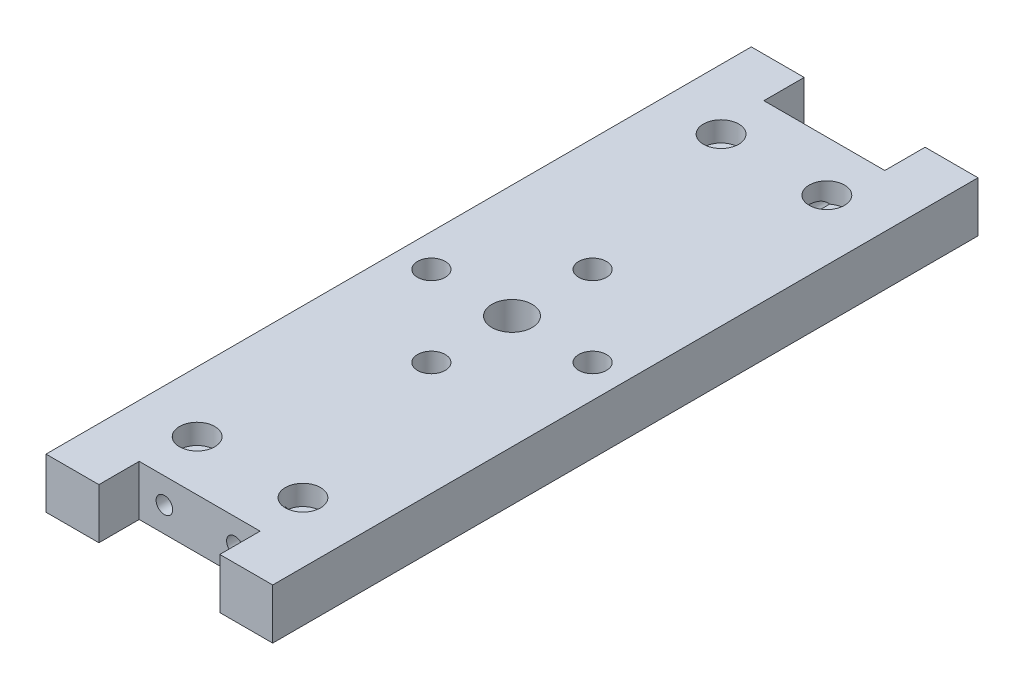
ISO-10303-21;
HEADER;
FILE_DESCRIPTION(('STEP AP214'),'2;1');
FILE_NAME('part.step','',(''),(''),'','','');
FILE_SCHEMA(('AUTOMOTIVE_DESIGN { 1 0 10303 214 1 1 1 1 }'));
ENDSEC;
DATA;
#1=APPLICATION_CONTEXT('core data for automotive mechanical design processes');
#2=APPLICATION_PROTOCOL_DEFINITION('international standard','automotive_design',2000,#1);
#3=PRODUCT_CONTEXT('',#1,'mechanical');
#4=PRODUCT('Part','Part','',(#3));
#5=PRODUCT_RELATED_PRODUCT_CATEGORY('part','',(#4));
#6=PRODUCT_DEFINITION_FORMATION('','',#4);
#7=PRODUCT_DEFINITION_CONTEXT('part definition',#1,'design');
#8=PRODUCT_DEFINITION('design','',#6,#7);
#9=PRODUCT_DEFINITION_SHAPE('','',#8);
#10=(LENGTH_UNIT() NAMED_UNIT(*) SI_UNIT(.MILLI.,.METRE.));
#11=(NAMED_UNIT(*) PLANE_ANGLE_UNIT() SI_UNIT($,.RADIAN.));
#12=(NAMED_UNIT(*) SI_UNIT($,.STERADIAN.) SOLID_ANGLE_UNIT());
#13=UNCERTAINTY_MEASURE_WITH_UNIT(LENGTH_MEASURE(1.E-05),#10,'distance_accuracy_value','');
#14=(GEOMETRIC_REPRESENTATION_CONTEXT(3) GLOBAL_UNCERTAINTY_ASSIGNED_CONTEXT((#13)) GLOBAL_UNIT_ASSIGNED_CONTEXT((#10,
#11,#12)) REPRESENTATION_CONTEXT('',''));
#15=CARTESIAN_POINT('',(0.,0.,0.));
#16=DIRECTION('',(0.,0.,1.));
#17=DIRECTION('',(1.,0.,0.));
#18=AXIS2_PLACEMENT_3D('',#15,#16,#17);
#19=CARTESIAN_POINT('',(-7.00000000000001,5.,-51.900000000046));
#20=DIRECTION('',(0.,0.,-1.));
#21=DIRECTION('',(0.,1.,0.));
#22=AXIS2_PLACEMENT_3D('',#19,#20,#21);
#23=CONICAL_SURFACE('',#22,1.65000000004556,1.02974425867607);
#24=CARTESIAN_POINT('',(-6.99999999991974,5.,-50.9085799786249));
#25=VERTEX_POINT('',#24);
#26=VERTEX_LOOP('',#25);
#27=FACE_BOUND('',#26,.T.);
#28=CARTESIAN_POINT('',(-7.00000000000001,5.,-51.9));
#29=DIRECTION('',(0.,0.,-1.));
#30=DIRECTION('',(-1.,0.,0.));
#31=AXIS2_PLACEMENT_3D('',#28,#29,#30);
#32=CIRCLE('',#31,1.64999999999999);
#33=CARTESIAN_POINT('',(-7.00142886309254,6.6499993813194,-51.9000000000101));
#34=VERTEX_POINT('',#33);
#35=CARTESIAN_POINT('',(-8.31244047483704,6.,-51.9000000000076));
#36=VERTEX_POINT('',#35);
#37=EDGE_CURVE('E188',#34,#36,#32,.T.);
#38=ORIENTED_EDGE('',*,*,#37,.T.);
#39=CARTESIAN_POINT('',(-7.03449829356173,6.,-51.5097980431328));
#40=CARTESIAN_POINT('',(-7.06323614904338,6.,-51.5103871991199));
#41=CARTESIAN_POINT('',(-7.09195203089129,6.,-51.5117317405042));
#42=CARTESIAN_POINT('',(-7.14926517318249,6.,-51.5158582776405));
#43=CARTESIAN_POINT('',(-7.17786248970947,6.,-51.5186394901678));
#44=CARTESIAN_POINT('',(-7.2632061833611,6.,-51.5290055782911));
#45=CARTESIAN_POINT('',(-7.31971208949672,6.,-51.5386182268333));
#46=CARTESIAN_POINT('',(-7.43119452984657,6.,-51.5621719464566));
#47=CARTESIAN_POINT('',(-7.48618064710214,6.,-51.57606943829));
#48=CARTESIAN_POINT('',(-7.59519866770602,6.,-51.6072236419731));
#49=CARTESIAN_POINT('',(-7.64923020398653,6.,-51.624481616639));
#50=CARTESIAN_POINT('',(-7.75470239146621,6.,-51.6609221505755));
#51=CARTESIAN_POINT('',(-7.80617072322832,6.,-51.6800258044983));
#52=CARTESIAN_POINT('',(-7.90839402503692,6.,-51.7200036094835));
#53=CARTESIAN_POINT('',(-7.95914917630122,6.,-51.74087730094));
#54=CARTESIAN_POINT('',(-8.06061027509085,6.,-51.7841889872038));
#55=CARTESIAN_POINT('',(-8.11131017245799,6.,-51.8066410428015));
#56=CARTESIAN_POINT('',(-8.21221628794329,6.,-51.8526026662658));
#57=CARTESIAN_POINT('',(-8.26242261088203,6.,-51.8761120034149));
#58=CARTESIAN_POINT('',(-8.31244047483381,6.,-51.9000000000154));
#59=B_SPLINE_CURVE_WITH_KNOTS('',3,(#39,#40,#41,#42,#43,#44,#45,#46,#47,#48,#49,#50,#51,#52,#53,
#54,#55,#56,#57,#58),.UNSPECIFIED.,.F.,.F.,(4,2,2,2,2,2,2,2,2,4),(0.,0.0862108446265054,
0.172374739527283,0.344081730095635,0.514096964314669,0.684176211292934,0.84883278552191,
1.01344673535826,1.1797799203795,1.34607698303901),.UNSPECIFIED.);
#60=CARTESIAN_POINT('',(-7.03449829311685,6.00000003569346,-51.5097980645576));
#61=VERTEX_POINT('',#60);
#62=EDGE_CURVE('E177',#61,#36,#59,.T.);
#63=ORIENTED_EDGE('',*,*,#62,.F.);
#64=CARTESIAN_POINT('',(-7.00142886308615,6.6499993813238,-51.9000000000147));
#65=CARTESIAN_POINT('',(-7.00236004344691,6.59578647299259,-51.8674269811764));
#66=CARTESIAN_POINT('',(-7.00374615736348,6.54157972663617,-51.8348566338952));
#67=CARTESIAN_POINT('',(-7.00743006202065,6.43319695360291,-51.7697420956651));
#68=CARTESIAN_POINT('',(-7.00972766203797,6.3790209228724,-51.7371979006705));
#69=CARTESIAN_POINT('',(-7.0152367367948,6.27069528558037,-51.6721428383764));
#70=CARTESIAN_POINT('',(-7.01844821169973,6.21654567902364,-51.6396319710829));
#71=CARTESIAN_POINT('',(-7.02578648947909,6.10826013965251,-51.5746650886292));
#72=CARTESIAN_POINT('',(-7.02991348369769,6.05412421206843,-51.5422090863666));
#73=CARTESIAN_POINT('',(-7.03449829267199,6.0000000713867,-51.5097980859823));
#74=B_SPLINE_CURVE_WITH_KNOTS('',3,(#64,#65,#66,#67,#68,#69,#70,#71,#72,#73),.UNSPECIFIED.,.F.,
.F.,(4,2,2,2,4),(0.,0.189756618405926,0.379473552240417,0.569190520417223,0.758947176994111),.UNSPECIFIED.);
#75=EDGE_CURVE('E21',#34,#61,#74,.T.);
#76=ORIENTED_EDGE('',*,*,#75,.F.);
#77=EDGE_LOOP('',(#38,#63,#76));
#78=FACE_BOUND('',#77,.T.);
#79=ADVANCED_FACE('F17',(#27,#78),#23,.F.);
#80=CARTESIAN_POINT('',(6.99999999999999,5.,-51.8999999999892));
#81=DIRECTION('',(0.,0.,-1.));
#82=DIRECTION('',(-1.,0.,0.));
#83=AXIS2_PLACEMENT_3D('',#80,#81,#82);
#84=CONICAL_SURFACE('',#83,1.65000000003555,1.02974425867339);
#85=CARTESIAN_POINT('',(7.000000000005,5.,-50.908579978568));
#86=VERTEX_POINT('',#85);
#87=VERTEX_LOOP('',#86);
#88=FACE_BOUND('',#87,.T.);
#89=CARTESIAN_POINT('',(8.3124404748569,5.99999999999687,-51.8999999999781));
#90=CARTESIAN_POINT('',(8.27194503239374,5.99999999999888,-51.8806524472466));
#91=CARTESIAN_POINT('',(8.23132456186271,5.9999999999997,-51.8615611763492));
#92=CARTESIAN_POINT('',(8.14976839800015,6.0000000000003,-51.8240341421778));
#93=CARTESIAN_POINT('',(8.10883261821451,6.00000000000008,-51.8055985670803));
#94=CARTESIAN_POINT('',(8.02629218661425,5.99999999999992,-51.7694004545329));
#95=CARTESIAN_POINT('',(7.98468481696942,5.99999999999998,-51.7516440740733));
#96=CARTESIAN_POINT('',(7.90104637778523,6.00000000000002,-51.717170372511));
#97=CARTESIAN_POINT('',(7.85901534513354,6.00000000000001,-51.7004529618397));
#98=CARTESIAN_POINT('',(7.73435926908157,5.99999999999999,-51.6530597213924));
#99=CARTESIAN_POINT('',(7.65103464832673,6.,-51.6241798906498));
#100=CARTESIAN_POINT('',(7.48223359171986,6.,-51.5742142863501));
#101=CARTESIAN_POINT('',(7.39676543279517,6.,-51.5531023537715));
#102=CARTESIAN_POINT('',(7.28760590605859,6.,-51.5336614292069));
#103=CARTESIAN_POINT('',(7.26484454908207,6.,-51.5300134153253));
#104=CARTESIAN_POINT('',(7.21919596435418,6.,-51.5235616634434));
#105=CARTESIAN_POINT('',(7.1963087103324,6.,-51.5207581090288));
#106=CARTESIAN_POINT('',(7.15029932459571,6.,-51.5160359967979));
#107=CARTESIAN_POINT('',(7.12717661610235,6.,-51.5141230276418));
#108=CARTESIAN_POINT('',(7.0808725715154,6.,-51.5112426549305));
#109=CARTESIAN_POINT('',(7.05769123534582,6.,-51.5102752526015));
#110=CARTESIAN_POINT('',(7.03449829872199,6.,-51.5097980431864));
#111=B_SPLINE_CURVE_WITH_KNOTS('',3,(#89,#90,#91,#92,#93,#94,#95,#96,#97,#98,#99,#100,#101,#102,
#103,#104,#105,#106,#107,#108,#109,#110),.UNSPECIFIED.,.F.,.F.,(4,2,2,2,2,2,2,2,2,2,4),(0.,
0.134642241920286,0.269322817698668,0.405023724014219,0.54071291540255,0.805070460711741,
1.06852943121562,1.13767213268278,1.20682985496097,1.27641589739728,1.34600203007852),.UNSPECIFIED.);
#112=CARTESIAN_POINT('',(8.312440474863,6.,-51.8999999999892));
#113=VERTEX_POINT('',#112);
#114=CARTESIAN_POINT('',(7.03449829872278,6.00000000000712,-51.5097980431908));
#115=VERTEX_POINT('',#114);
#116=EDGE_CURVE('E193',#113,#115,#111,.T.);
#117=ORIENTED_EDGE('',*,*,#116,.F.);
#118=CARTESIAN_POINT('',(6.99999999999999,5.,-51.9));
#119=DIRECTION('',(0.,0.,-1.));
#120=DIRECTION('',(-1.,0.,0.));
#121=AXIS2_PLACEMENT_3D('',#118,#119,#120);
#122=CIRCLE('',#121,1.64999999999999);
#123=CARTESIAN_POINT('',(7.00142886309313,6.64999938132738,-51.8999999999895));
#124=VERTEX_POINT('',#123);
#125=EDGE_CURVE('E344',#113,#124,#122,.T.);
#126=ORIENTED_EDGE('',*,*,#125,.T.);
#127=CARTESIAN_POINT('',(7.03449829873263,6.00000000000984,-51.5097980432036));
#128=CARTESIAN_POINT('',(7.02991348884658,6.05412414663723,-51.5422090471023));
#129=CARTESIAN_POINT('',(7.02578649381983,6.10826008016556,-51.574665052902));
#130=CARTESIAN_POINT('',(7.01844821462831,6.2165456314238,-51.6396319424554));
#131=CARTESIAN_POINT('',(7.01523673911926,6.27069524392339,-51.6721428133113));
#132=CARTESIAN_POINT('',(7.00972766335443,6.37902089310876,-51.7371978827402));
#133=CARTESIAN_POINT('',(7.00743006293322,6.43319692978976,-51.7697420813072));
#134=CARTESIAN_POINT('',(7.00374615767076,6.54157971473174,-51.8348566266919));
#135=CARTESIAN_POINT('',(7.00236004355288,6.59578646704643,-51.8674269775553));
#136=CARTESIAN_POINT('',(7.00142886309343,6.64999938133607,-51.8999999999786));
#137=B_SPLINE_CURVE_WITH_KNOTS('',3,(#127,#128,#129,#130,#131,#132,#133,#134,#135,#136),
.UNSPECIFIED.,.F.,.F.,(4,2,2,2,4),(0.,0.189756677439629,0.379473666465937,0.569190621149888,
0.758947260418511),.UNSPECIFIED.);
#138=EDGE_CURVE('E187',#115,#124,#137,.T.);
#139=ORIENTED_EDGE('',*,*,#138,.F.);
#140=EDGE_LOOP('',(#117,#126,#139));
#141=FACE_BOUND('',#140,.T.);
#142=ADVANCED_FACE('F225',(#88,#141),#84,.F.);
#143=CARTESIAN_POINT('',(-7.00000000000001,5.,51.8999999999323));
#144=DIRECTION('',(0.,0.,1.));
#145=DIRECTION('',(1.,0.,0.));
#146=AXIS2_PLACEMENT_3D('',#143,#144,#145);
#147=CONICAL_SURFACE('',#146,1.64999999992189,1.02974425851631);
#148=CARTESIAN_POINT('',(-6.99999999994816,5.,50.9085799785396));
#149=VERTEX_POINT('',#148);
#150=VERTEX_LOOP('',#149);
#151=FACE_BOUND('',#150,.T.);
#152=CARTESIAN_POINT('',(-8.31244047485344,6.,51.8999999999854));
#153=CARTESIAN_POINT('',(-8.27194503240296,6.,51.8806524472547));
#154=CARTESIAN_POINT('',(-8.23132456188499,6.,51.8615611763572));
#155=CARTESIAN_POINT('',(-8.14976839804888,6.,51.8240341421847));
#156=CARTESIAN_POINT('',(-8.10883261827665,6.,51.8055985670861));
#157=CARTESIAN_POINT('',(-8.0262921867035,6.,51.7694004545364));
#158=CARTESIAN_POINT('',(-7.98468481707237,6.,51.7516440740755));
#159=CARTESIAN_POINT('',(-7.90104637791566,6.,51.71717037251));
#160=CARTESIAN_POINT('',(-7.85901534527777,6.,51.7004529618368));
#161=CARTESIAN_POINT('',(-7.73435926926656,6.,51.6530597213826));
#162=CARTESIAN_POINT('',(-7.65103464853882,6.,51.624179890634));
#163=CARTESIAN_POINT('',(-7.48223359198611,6.,51.5742142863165));
#164=CARTESIAN_POINT('',(-7.39676543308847,6.,51.5531023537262));
#165=CARTESIAN_POINT('',(-7.28760590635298,6.,51.5336614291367));
#166=CARTESIAN_POINT('',(-7.26484454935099,6.,51.5300134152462));
#167=CARTESIAN_POINT('',(-7.21919596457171,6.,51.5235616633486));
#168=CARTESIAN_POINT('',(-7.19630871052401,6.,51.5207581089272));
#169=CARTESIAN_POINT('',(-7.15029932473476,6.,51.5160359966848));
#170=CARTESIAN_POINT('',(-7.12717661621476,6.,51.5141230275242));
#171=CARTESIAN_POINT('',(-7.08087257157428,6.,51.5112426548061));
#172=CARTESIAN_POINT('',(-7.05769123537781,6.,51.510275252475));
#173=CARTESIAN_POINT('',(-7.03449829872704,6.,51.5097980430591));
#174=B_SPLINE_CURVE_WITH_KNOTS('',3,(#152,#153,#154,#155,#156,#157,#158,#159,#160,#161,#162,
#163,#164,#165,#166,#167,#168,#169,#170,#171,#172,#173),.UNSPECIFIED.,.F.,.F.,(4,2,2,2,2,2,2,2,
2,2,4),(0.,0.134642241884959,0.26932281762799,0.405023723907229,0.540712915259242,
0.805070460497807,1.06852943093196,1.13767213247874,1.20682985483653,1.27641589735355,
1.34600203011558),.UNSPECIFIED.);
#175=CARTESIAN_POINT('',(-8.31244047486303,6.,51.8999999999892));
#176=VERTEX_POINT('',#175);
#177=CARTESIAN_POINT('',(-7.0344982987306,6.0000000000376,51.5097980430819));
#178=VERTEX_POINT('',#177);
#179=EDGE_CURVE('E491',#176,#178,#174,.T.);
#180=ORIENTED_EDGE('',*,*,#179,.F.);
#181=CARTESIAN_POINT('',(-7.00000000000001,5.,51.9));
#182=DIRECTION('',(0.,0.,1.));
#183=DIRECTION('',(1.,0.,0.));
#184=AXIS2_PLACEMENT_3D('',#181,#182,#183);
#185=CIRCLE('',#184,1.64999999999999);
#186=CARTESIAN_POINT('',(-7.00142886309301,6.64999938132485,51.8999999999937));
#187=VERTEX_POINT('',#186);
#188=EDGE_CURVE('E328',#176,#187,#185,.T.);
#189=ORIENTED_EDGE('',*,*,#188,.T.);
#190=CARTESIAN_POINT('',(-7.03449829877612,6.00000000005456,51.5097980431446));
#191=CARTESIAN_POINT('',(-7.02991348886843,6.05412414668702,51.5422090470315));
#192=CARTESIAN_POINT('',(-7.0257864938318,6.10826008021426,51.5746650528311));
#193=CARTESIAN_POINT('',(-7.0184482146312,6.21654563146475,51.6396319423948));
#194=CARTESIAN_POINT('',(-7.01523673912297,6.2706952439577,51.6721428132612));
#195=CARTESIAN_POINT('',(-7.00972766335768,6.37902089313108,51.7371978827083));
#196=CARTESIAN_POINT('',(-7.00743006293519,6.43319692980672,51.7697420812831));
#197=CARTESIAN_POINT('',(-7.00374615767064,6.54157971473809,51.8348566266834));
#198=CARTESIAN_POINT('',(-7.00236004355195,6.59578646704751,51.8674269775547));
#199=CARTESIAN_POINT('',(-7.00142886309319,6.64999938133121,51.8999999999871));
#200=B_SPLINE_CURVE_WITH_KNOTS('',3,(#190,#191,#192,#193,#194,#195,#196,#197,#198,#199),
.UNSPECIFIED.,.F.,.F.,(4,2,2,2,4),(0.,0.189756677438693,0.379473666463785,0.569190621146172,
0.758947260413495),.UNSPECIFIED.);
#201=EDGE_CURVE('E239',#178,#187,#200,.T.);
#202=ORIENTED_EDGE('',*,*,#201,.F.);
#203=EDGE_LOOP('',(#180,#189,#202));
#204=FACE_BOUND('',#203,.T.);
#205=ADVANCED_FACE('F229',(#151,#204),#147,.F.);
#206=CARTESIAN_POINT('',(-10.5,0.,52.));
#207=DIRECTION('',(0.,1.,0.));
#208=DIRECTION('',(0.,0.,1.));
#209=AXIS2_PLACEMENT_3D('',#206,#207,#208);
#210=CYLINDRICAL_SURFACE('',#209,1.75);
#211=CARTESIAN_POINT('',(-10.5,6.,52.));
#212=DIRECTION('',(0.,1.,0.));
#213=DIRECTION('',(0.,0.,1.));
#214=AXIS2_PLACEMENT_3D('',#211,#212,#213);
#215=CIRCLE('',#214,1.75);
#216=CARTESIAN_POINT('',(-10.5,6.,53.75));
#217=VERTEX_POINT('',#216);
#218=EDGE_CURVE('E492',#217,#217,#215,.F.);
#219=ORIENTED_EDGE('',*,*,#218,.F.);
#220=EDGE_LOOP('',(#219));
#221=FACE_BOUND('',#220,.T.);
#222=CARTESIAN_POINT('',(-10.5,0.,52.));
#223=DIRECTION('',(0.,1.,0.));
#224=DIRECTION('',(0.,0.,1.));
#225=AXIS2_PLACEMENT_3D('',#222,#223,#224);
#226=CIRCLE('',#225,1.75);
#227=CARTESIAN_POINT('',(-10.5,0.,53.75));
#228=VERTEX_POINT('',#227);
#229=EDGE_CURVE('E200',#228,#228,#226,.F.);
#230=ORIENTED_EDGE('',*,*,#229,.T.);
#231=EDGE_LOOP('',(#230));
#232=FACE_BOUND('',#231,.T.);
#233=ADVANCED_FACE('F443',(#221,#232),#210,.F.);
#234=CARTESIAN_POINT('',(10.5,0.,-52.));
#235=DIRECTION('',(0.,1.,0.));
#236=DIRECTION('',(0.,0.,1.));
#237=AXIS2_PLACEMENT_3D('',#234,#235,#236);
#238=CYLINDRICAL_SURFACE('',#237,1.75);
#239=CARTESIAN_POINT('',(10.5,0.,-52.));
#240=DIRECTION('',(0.,1.,0.));
#241=DIRECTION('',(0.,0.,1.));
#242=AXIS2_PLACEMENT_3D('',#239,#240,#241);
#243=CIRCLE('',#242,1.75);
#244=CARTESIAN_POINT('',(10.5,0.,-50.25));
#245=VERTEX_POINT('',#244);
#246=EDGE_CURVE('E319',#245,#245,#243,.F.);
#247=ORIENTED_EDGE('',*,*,#246,.T.);
#248=EDGE_LOOP('',(#247));
#249=FACE_BOUND('',#248,.T.);
#250=CARTESIAN_POINT('',(10.5,6.,-52.));
#251=DIRECTION('',(0.,1.,0.));
#252=DIRECTION('',(0.,0.,1.));
#253=AXIS2_PLACEMENT_3D('',#250,#251,#252);
#254=CIRCLE('',#253,1.75);
#255=CARTESIAN_POINT('',(10.5,6.,-50.25));
#256=VERTEX_POINT('',#255);
#257=EDGE_CURVE('E223',#256,#256,#254,.F.);
#258=ORIENTED_EDGE('',*,*,#257,.F.);
#259=EDGE_LOOP('',(#258));
#260=FACE_BOUND('',#259,.T.);
#261=ADVANCED_FACE('F440',(#249,#260),#238,.F.);
#262=CARTESIAN_POINT('',(-10.5,0.,-52.));
#263=DIRECTION('',(0.,1.,0.));
#264=DIRECTION('',(0.,0.,1.));
#265=AXIS2_PLACEMENT_3D('',#262,#263,#264);
#266=CYLINDRICAL_SURFACE('',#265,1.75);
#267=CARTESIAN_POINT('',(-10.5,0.,-52.));
#268=DIRECTION('',(0.,1.,0.));
#269=DIRECTION('',(0.,0.,1.));
#270=AXIS2_PLACEMENT_3D('',#267,#268,#269);
#271=CIRCLE('',#270,1.75);
#272=CARTESIAN_POINT('',(-10.5,0.,-50.25));
#273=VERTEX_POINT('',#272);
#274=EDGE_CURVE('E317',#273,#273,#271,.F.);
#275=ORIENTED_EDGE('',*,*,#274,.T.);
#276=EDGE_LOOP('',(#275));
#277=FACE_BOUND('',#276,.T.);
#278=CARTESIAN_POINT('',(-10.5,6.,-52.));
#279=DIRECTION('',(0.,1.,0.));
#280=DIRECTION('',(0.,0.,1.));
#281=AXIS2_PLACEMENT_3D('',#278,#279,#280);
#282=CIRCLE('',#281,1.75);
#283=CARTESIAN_POINT('',(-10.5,6.,-50.25));
#284=VERTEX_POINT('',#283);
#285=EDGE_CURVE('E189',#284,#284,#282,.F.);
#286=ORIENTED_EDGE('',*,*,#285,.F.);
#287=EDGE_LOOP('',(#286));
#288=FACE_BOUND('',#287,.T.);
#289=ADVANCED_FACE('F436',(#277,#288),#266,.F.);
#290=CARTESIAN_POINT('',(0.,5.,-16.));
#291=DIRECTION('',(0.,-1.,0.));
#292=DIRECTION('',(0.,0.,-1.));
#293=AXIS2_PLACEMENT_3D('',#290,#291,#292);
#294=CYLINDRICAL_SURFACE('',#293,5.);
#295=CARTESIAN_POINT('',(0.,0.,-16.));
#296=DIRECTION('',(0.,-1.,0.));
#297=DIRECTION('',(0.,0.,-1.));
#298=AXIS2_PLACEMENT_3D('',#295,#296,#297);
#299=CIRCLE('',#298,5.);
#300=CARTESIAN_POINT('',(0.,0.,-21.));
#301=VERTEX_POINT('',#300);
#302=EDGE_CURVE('E311',#301,#301,#299,.T.);
#303=ORIENTED_EDGE('',*,*,#302,.T.);
#304=EDGE_LOOP('',(#303));
#305=FACE_BOUND('',#304,.T.);
#306=CARTESIAN_POINT('',(0.,5.,-16.));
#307=DIRECTION('',(0.,-1.,0.));
#308=DIRECTION('',(0.,0.,-1.));
#309=AXIS2_PLACEMENT_3D('',#306,#307,#308);
#310=CIRCLE('',#309,5.);
#311=CARTESIAN_POINT('',(0.,5.,-21.));
#312=VERTEX_POINT('',#311);
#313=EDGE_CURVE('E299',#312,#312,#310,.T.);
#314=ORIENTED_EDGE('',*,*,#313,.F.);
#315=EDGE_LOOP('',(#314));
#316=FACE_BOUND('',#315,.T.);
#317=ADVANCED_FACE('F432',(#305,#316),#294,.F.);
#318=CARTESIAN_POINT('',(0.,5.,16.));
#319=DIRECTION('',(0.,-1.,0.));
#320=DIRECTION('',(0.,0.,-1.));
#321=AXIS2_PLACEMENT_3D('',#318,#319,#320);
#322=CYLINDRICAL_SURFACE('',#321,5.);
#323=CARTESIAN_POINT('',(0.,0.,16.));
#324=DIRECTION('',(0.,-1.,0.));
#325=DIRECTION('',(0.,0.,-1.));
#326=AXIS2_PLACEMENT_3D('',#323,#324,#325);
#327=CIRCLE('',#326,5.);
#328=CARTESIAN_POINT('',(0.,0.,11.));
#329=VERTEX_POINT('',#328);
#330=EDGE_CURVE('E305',#329,#329,#327,.T.);
#331=ORIENTED_EDGE('',*,*,#330,.T.);
#332=EDGE_LOOP('',(#331));
#333=FACE_BOUND('',#332,.T.);
#334=CARTESIAN_POINT('',(0.,5.,16.));
#335=DIRECTION('',(0.,-1.,0.));
#336=DIRECTION('',(0.,0.,-1.));
#337=AXIS2_PLACEMENT_3D('',#334,#335,#336);
#338=CIRCLE('',#337,5.);
#339=CARTESIAN_POINT('',(0.,5.,11.));
#340=VERTEX_POINT('',#339);
#341=EDGE_CURVE('E296',#340,#340,#338,.T.);
#342=ORIENTED_EDGE('',*,*,#341,.F.);
#343=EDGE_LOOP('',(#342));
#344=FACE_BOUND('',#343,.T.);
#345=ADVANCED_FACE('F428',(#333,#344),#322,.F.);
#346=CARTESIAN_POINT('',(16.,5.,0.));
#347=DIRECTION('',(0.,-1.,0.));
#348=DIRECTION('',(0.,0.,-1.));
#349=AXIS2_PLACEMENT_3D('',#346,#347,#348);
#350=CYLINDRICAL_SURFACE('',#349,5.);
#351=CARTESIAN_POINT('',(16.,0.,0.));
#352=DIRECTION('',(0.,-1.,0.));
#353=DIRECTION('',(0.,0.,-1.));
#354=AXIS2_PLACEMENT_3D('',#351,#352,#353);
#355=CIRCLE('',#354,5.);
#356=CARTESIAN_POINT('',(16.,0.,-5.));
#357=VERTEX_POINT('',#356);
#358=EDGE_CURVE('E314',#357,#357,#355,.T.);
#359=ORIENTED_EDGE('',*,*,#358,.T.);
#360=EDGE_LOOP('',(#359));
#361=FACE_BOUND('',#360,.T.);
#362=CARTESIAN_POINT('',(16.,5.,0.));
#363=DIRECTION('',(0.,-1.,0.));
#364=DIRECTION('',(0.,0.,-1.));
#365=AXIS2_PLACEMENT_3D('',#362,#363,#364);
#366=CIRCLE('',#365,5.);
#367=CARTESIAN_POINT('',(16.,5.,-5.));
#368=VERTEX_POINT('',#367);
#369=EDGE_CURVE('E293',#368,#368,#366,.T.);
#370=ORIENTED_EDGE('',*,*,#369,.F.);
#371=EDGE_LOOP('',(#370));
#372=FACE_BOUND('',#371,.T.);
#373=ADVANCED_FACE('F424',(#361,#372),#350,.F.);
#374=CARTESIAN_POINT('',(-16.,5.,0.));
#375=DIRECTION('',(0.,-1.,0.));
#376=DIRECTION('',(0.,0.,-1.));
#377=AXIS2_PLACEMENT_3D('',#374,#375,#376);
#378=CYLINDRICAL_SURFACE('',#377,5.);
#379=CARTESIAN_POINT('',(-16.,0.,0.));
#380=DIRECTION('',(0.,-1.,0.));
#381=DIRECTION('',(0.,0.,-1.));
#382=AXIS2_PLACEMENT_3D('',#379,#380,#381);
#383=CIRCLE('',#382,5.);
#384=CARTESIAN_POINT('',(-16.,0.,-5.));
#385=VERTEX_POINT('',#384);
#386=EDGE_CURVE('E308',#385,#385,#383,.T.);
#387=ORIENTED_EDGE('',*,*,#386,.T.);
#388=EDGE_LOOP('',(#387));
#389=FACE_BOUND('',#388,.T.);
#390=CARTESIAN_POINT('',(-16.,5.,0.));
#391=DIRECTION('',(0.,-1.,0.));
#392=DIRECTION('',(0.,0.,-1.));
#393=AXIS2_PLACEMENT_3D('',#390,#391,#392);
#394=CIRCLE('',#393,5.);
#395=CARTESIAN_POINT('',(-16.,5.,-5.));
#396=VERTEX_POINT('',#395);
#397=EDGE_CURVE('E290',#396,#396,#394,.T.);
#398=ORIENTED_EDGE('',*,*,#397,.F.);
#399=EDGE_LOOP('',(#398));
#400=FACE_BOUND('',#399,.T.);
#401=ADVANCED_FACE('F419',(#389,#400),#378,.F.);
#402=CARTESIAN_POINT('',(6.99999999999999,5.,51.900000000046));
#403=DIRECTION('',(0.,0.,1.));
#404=DIRECTION('',(0.,-1.,0.));
#405=AXIS2_PLACEMENT_3D('',#402,#403,#404);
#406=CONICAL_SURFACE('',#405,1.65000000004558,1.02974425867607);
#407=CARTESIAN_POINT('',(6.99999999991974,5.,50.9085799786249));
#408=VERTEX_POINT('',#407);
#409=VERTEX_LOOP('',#408);
#410=FACE_BOUND('',#409,.T.);
#411=CARTESIAN_POINT('',(6.99999999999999,5.,51.9));
#412=DIRECTION('',(0.,0.,1.));
#413=DIRECTION('',(1.,0.,0.));
#414=AXIS2_PLACEMENT_3D('',#411,#412,#413);
#415=CIRCLE('',#414,1.64999999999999);
#416=CARTESIAN_POINT('',(7.00142886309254,6.6499993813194,51.9000000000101));
#417=VERTEX_POINT('',#416);
#418=CARTESIAN_POINT('',(8.31244047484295,6.,51.9000000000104));
#419=VERTEX_POINT('',#418);
#420=EDGE_CURVE('E289',#417,#419,#415,.T.);
#421=ORIENTED_EDGE('',*,*,#420,.T.);
#422=CARTESIAN_POINT('',(7.03449829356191,6.,51.5097980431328));
#423=CARTESIAN_POINT('',(7.06323614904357,6.,51.5103871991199));
#424=CARTESIAN_POINT('',(7.09195203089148,6.,51.5117317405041));
#425=CARTESIAN_POINT('',(7.14926517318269,6.,51.5158582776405));
#426=CARTESIAN_POINT('',(7.17786248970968,6.,51.5186394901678));
#427=CARTESIAN_POINT('',(7.26320618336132,6.,51.5290055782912));
#428=CARTESIAN_POINT('',(7.31971208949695,6.,51.5386182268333));
#429=CARTESIAN_POINT('',(7.43119452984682,6.,51.5621719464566));
#430=CARTESIAN_POINT('',(7.48618064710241,6.,51.5760694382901));
#431=CARTESIAN_POINT('',(7.5951986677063,6.,51.6072236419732));
#432=CARTESIAN_POINT('',(7.64923020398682,6.,51.6244816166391));
#433=CARTESIAN_POINT('',(7.75470239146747,6.,51.660922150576));
#434=CARTESIAN_POINT('',(7.80617072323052,6.,51.6800258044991));
#435=CARTESIAN_POINT('',(7.908394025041,6.,51.7200036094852));
#436=CARTESIAN_POINT('',(7.95914917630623,6.,51.7408773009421));
#437=CARTESIAN_POINT('',(8.06061027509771,6.,51.7841889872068));
#438=CARTESIAN_POINT('',(8.11131017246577,6.,51.8066410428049));
#439=CARTESIAN_POINT('',(8.21221628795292,6.,51.8526026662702));
#440=CARTESIAN_POINT('',(8.26242261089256,6.,51.8761120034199));
#441=CARTESIAN_POINT('',(8.31244047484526,6.,51.9000000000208));
#442=B_SPLINE_CURVE_WITH_KNOTS('',3,(#422,#423,#424,#425,#426,#427,#428,#429,#430,#431,#432,
#433,#434,#435,#436,#437,#438,#439,#440,#441),.UNSPECIFIED.,.F.,.F.,(4,2,2,2,2,2,2,2,2,4),(0.,
0.0862108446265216,0.172374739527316,0.344081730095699,0.51409696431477,0.684176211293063,
0.848832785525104,1.01344673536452,1.17977992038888,1.34607698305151),.UNSPECIFIED.);
#443=CARTESIAN_POINT('',(7.03449829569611,6.00000003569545,51.5097980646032));
#444=VERTEX_POINT('',#443);
#445=EDGE_CURVE('E409',#444,#419,#442,.T.);
#446=ORIENTED_EDGE('',*,*,#445,.F.);
#447=CARTESIAN_POINT('',(7.00142886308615,6.64999938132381,51.9000000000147));
#448=CARTESIAN_POINT('',(7.00236004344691,6.59578647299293,51.8674269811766));
#449=CARTESIAN_POINT('',(7.00374615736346,6.54157972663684,51.8348566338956));
#450=CARTESIAN_POINT('',(7.0074300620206,6.43319695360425,51.7697420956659));
#451=CARTESIAN_POINT('',(7.00972766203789,6.37902092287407,51.7371979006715));
#452=CARTESIAN_POINT('',(7.01523673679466,6.27069528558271,51.6721428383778));
#453=CARTESIAN_POINT('',(7.01844821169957,6.21654567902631,51.6396319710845));
#454=CARTESIAN_POINT('',(7.02578648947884,6.10826013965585,51.5746650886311));
#455=CARTESIAN_POINT('',(7.0299134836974,6.05412421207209,51.5422090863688));
#456=CARTESIAN_POINT('',(7.03449829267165,6.0000000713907,51.5097980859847));
#457=B_SPLINE_CURVE_WITH_KNOTS('',3,(#447,#448,#449,#450,#451,#452,#453,#454,#455,#456),
.UNSPECIFIED.,.F.,.F.,(4,2,2,2,4),(0.,0.189756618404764,0.379473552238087,0.569190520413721,
0.758947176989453),.UNSPECIFIED.);
#458=EDGE_CURVE('E402',#417,#444,#457,.T.);
#459=ORIENTED_EDGE('',*,*,#458,.F.);
#460=EDGE_LOOP('',(#421,#446,#459));
#461=FACE_BOUND('',#460,.T.);
#462=ADVANCED_FACE('F414',(#410,#461),#406,.F.);
#463=CARTESIAN_POINT('',(10.5,0.,52.));
#464=DIRECTION('',(0.,1.,0.));
#465=DIRECTION('',(0.,0.,1.));
#466=AXIS2_PLACEMENT_3D('',#463,#464,#465);
#467=CYLINDRICAL_SURFACE('',#466,1.75);
#468=CARTESIAN_POINT('',(10.5,6.,52.));
#469=DIRECTION('',(0.,1.,0.));
#470=DIRECTION('',(0.,0.,1.));
#471=AXIS2_PLACEMENT_3D('',#468,#469,#470);
#472=CIRCLE('',#471,1.75);
#473=CARTESIAN_POINT('',(10.5,6.,53.75));
#474=VERTEX_POINT('',#473);
#475=EDGE_CURVE('E286',#474,#474,#472,.F.);
#476=ORIENTED_EDGE('',*,*,#475,.F.);
#477=EDGE_LOOP('',(#476));
#478=FACE_BOUND('',#477,.T.);
#479=CARTESIAN_POINT('',(10.5,0.,52.));
#480=DIRECTION('',(0.,1.,0.));
#481=DIRECTION('',(0.,0.,1.));
#482=AXIS2_PLACEMENT_3D('',#479,#480,#481);
#483=CIRCLE('',#482,1.75);
#484=CARTESIAN_POINT('',(10.5,0.,53.75));
#485=VERTEX_POINT('',#484);
#486=EDGE_CURVE('E302',#485,#485,#483,.F.);
#487=ORIENTED_EDGE('',*,*,#486,.T.);
#488=EDGE_LOOP('',(#487));
#489=FACE_BOUND('',#488,.T.);
#490=ADVANCED_FACE('F418',(#478,#489),#467,.F.);
#491=CARTESIAN_POINT('',(-10.5,6.,52.));
#492=DIRECTION('',(0.,1.,0.));
#493=DIRECTION('',(0.,0.,1.));
#494=AXIS2_PLACEMENT_3D('',#491,#492,#493);
#495=PLANE('',#494);
#496=CARTESIAN_POINT('',(-10.5,6.,52.));
#497=DIRECTION('',(0.,1.,0.));
#498=DIRECTION('',(0.,0.,1.));
#499=AXIS2_PLACEMENT_3D('',#496,#497,#498);
#500=CIRCLE('',#499,3.5);
#501=CARTESIAN_POINT('',(-8.31244047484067,6.,54.7321389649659));
#502=VERTEX_POINT('',#501);
#503=EDGE_CURVE('E264',#178,#502,#500,.T.);
#504=ORIENTED_EDGE('',*,*,#503,.T.);
#505=DIRECTION('',(0.,0.,1.));
#506=VECTOR('',#505,1.);
#507=CARTESIAN_POINT('',(-8.31244047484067,6.,62.));
#508=LINE('',#507,#506);
#509=EDGE_CURVE('E324',#502,#176,#508,.F.);
#510=ORIENTED_EDGE('',*,*,#509,.T.);
#511=ORIENTED_EDGE('',*,*,#179,.T.);
#512=EDGE_LOOP('',(#504,#510,#511));
#513=FACE_BOUND('',#512,.T.);
#514=ORIENTED_EDGE('',*,*,#218,.T.);
#515=EDGE_LOOP('',(#514));
#516=FACE_BOUND('',#515,.T.);
#517=ADVANCED_FACE('F214',(#513,#516),#495,.T.);
#518=CARTESIAN_POINT('',(10.5,6.,-52.));
#519=DIRECTION('',(0.,1.,0.));
#520=DIRECTION('',(0.,0.,1.));
#521=AXIS2_PLACEMENT_3D('',#518,#519,#520);
#522=PLANE('',#521);
#523=CARTESIAN_POINT('',(10.5,6.,-52.));
#524=DIRECTION('',(0.,1.,0.));
#525=DIRECTION('',(0.,0.,1.));
#526=AXIS2_PLACEMENT_3D('',#523,#524,#525);
#527=CIRCLE('',#526,3.5);
#528=CARTESIAN_POINT('',(8.31244047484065,6.,-54.7321389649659));
#529=VERTEX_POINT('',#528);
#530=EDGE_CURVE('E263',#115,#529,#527,.T.);
#531=ORIENTED_EDGE('',*,*,#530,.T.);
#532=DIRECTION('',(0.,0.,-1.));
#533=VECTOR('',#532,1.);
#534=CARTESIAN_POINT('',(8.31244047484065,6.,-62.));
#535=LINE('',#534,#533);
#536=EDGE_CURVE('E334',#529,#113,#535,.F.);
#537=ORIENTED_EDGE('',*,*,#536,.T.);
#538=ORIENTED_EDGE('',*,*,#116,.T.);
#539=EDGE_LOOP('',(#531,#537,#538));
#540=FACE_BOUND('',#539,.T.);
#541=ORIENTED_EDGE('',*,*,#257,.T.);
#542=EDGE_LOOP('',(#541));
#543=FACE_BOUND('',#542,.T.);
#544=ADVANCED_FACE('F208',(#540,#543),#522,.T.);
#545=CARTESIAN_POINT('',(-10.5,6.,-52.));
#546=DIRECTION('',(0.,1.,0.));
#547=DIRECTION('',(0.,0.,1.));
#548=AXIS2_PLACEMENT_3D('',#545,#546,#547);
#549=PLANE('',#548);
#550=CARTESIAN_POINT('',(-10.5,6.,-52.));
#551=DIRECTION('',(0.,1.,0.));
#552=DIRECTION('',(0.,0.,1.));
#553=AXIS2_PLACEMENT_3D('',#550,#551,#552);
#554=CIRCLE('',#553,3.5);
#555=CARTESIAN_POINT('',(-8.31244047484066,6.,-54.7321389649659));
#556=VERTEX_POINT('',#555);
#557=EDGE_CURVE('E174',#556,#61,#554,.T.);
#558=ORIENTED_EDGE('',*,*,#557,.T.);
#559=ORIENTED_EDGE('',*,*,#62,.T.);
#560=DIRECTION('',(0.,0.,-1.));
#561=VECTOR('',#560,1.);
#562=CARTESIAN_POINT('',(-8.31244047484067,6.,-62.));
#563=LINE('',#562,#561);
#564=EDGE_CURVE('E179',#36,#556,#563,.T.);
#565=ORIENTED_EDGE('',*,*,#564,.T.);
#566=EDGE_LOOP('',(#558,#559,#565));
#567=FACE_BOUND('',#566,.T.);
#568=ORIENTED_EDGE('',*,*,#285,.T.);
#569=EDGE_LOOP('',(#568));
#570=FACE_BOUND('',#569,.T.);
#571=ADVANCED_FACE('F175',(#567,#570),#549,.T.);
#572=CARTESIAN_POINT('',(-7.00000000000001,5.,-62.));
#573=DIRECTION('',(0.,0.,-1.));
#574=DIRECTION('',(-1.,0.,0.));
#575=AXIS2_PLACEMENT_3D('',#572,#573,#574);
#576=CYLINDRICAL_SURFACE('',#575,1.64999999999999);
#577=ORIENTED_EDGE('',*,*,#564,.F.);
#578=ORIENTED_EDGE('',*,*,#37,.F.);
#579=CARTESIAN_POINT('',(-7.00142886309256,6.64999938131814,-51.9000000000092));
#580=CARTESIAN_POINT('',(-7.00002874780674,6.64999754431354,-51.9489860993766));
#581=CARTESIAN_POINT('',(-6.99965768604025,6.64999953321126,-51.9979956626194));
#582=CARTESIAN_POINT('',(-7.00097323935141,6.65000040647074,-52.0959860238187));
#583=CARTESIAN_POINT('',(-7.0026598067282,6.64999929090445,-52.1449668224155));
#584=CARTESIAN_POINT('',(-7.01080573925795,6.64997515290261,-52.291764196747));
#585=CARTESIAN_POINT('',(-7.02035157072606,6.64993133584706,-52.3894274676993));
#586=CARTESIAN_POINT('',(-7.04768246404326,6.64936727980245,-52.5841474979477));
#587=CARTESIAN_POINT('',(-7.06551416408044,6.64884432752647,-52.6811976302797));
#588=CARTESIAN_POINT('',(-7.10929988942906,6.64652212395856,-52.8734202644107));
#589=CARTESIAN_POINT('',(-7.13525187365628,6.64472319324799,-52.9685932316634));
#590=CARTESIAN_POINT('',(-7.1896635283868,6.63924710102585,-53.1393823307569));
#591=CARTESIAN_POINT('',(-7.21682450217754,6.63596768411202,-53.2154270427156));
#592=CARTESIAN_POINT('',(-7.27627991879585,6.62698313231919,-53.3653305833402));
#593=CARTESIAN_POINT('',(-7.3085734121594,6.62127844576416,-53.4391898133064));
#594=CARTESIAN_POINT('',(-7.3779530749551,6.60651978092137,-53.5840621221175));
#595=CARTESIAN_POINT('',(-7.41502689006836,6.59747432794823,-53.6550819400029));
#596=CARTESIAN_POINT('',(-7.49360488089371,6.57496768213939,-53.7938647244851));
#597=CARTESIAN_POINT('',(-7.53510726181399,6.56150827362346,-53.8616289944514));
#598=CARTESIAN_POINT('',(-7.63885418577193,6.5226677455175,-54.0188592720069));
#599=CARTESIAN_POINT('',(-7.70289881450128,6.49468724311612,-54.1065442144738));
#600=CARTESIAN_POINT('',(-7.8355618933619,6.42475428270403,-54.2719930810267));
#601=CARTESIAN_POINT('',(-7.90416317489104,6.38285212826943,-54.3497913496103));
#602=CARTESIAN_POINT('',(-8.03141119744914,6.28992286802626,-54.4825804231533));
#603=CARTESIAN_POINT('',(-8.08999235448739,6.2412382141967,-54.5392409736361));
#604=CARTESIAN_POINT('',(-8.1756551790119,6.15842113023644,-54.617048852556));
#605=CARTESIAN_POINT('',(-8.20398875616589,6.12899714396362,-54.6419024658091));
#606=CARTESIAN_POINT('',(-8.25933777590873,6.06691324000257,-54.689006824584));
#607=CARTESIAN_POINT('',(-8.28635156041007,6.03424940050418,-54.7112543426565));
#608=CARTESIAN_POINT('',(-8.31244047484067,6.00000000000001,-54.7321389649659));
#609=B_SPLINE_CURVE_WITH_KNOTS('',3,(#579,#580,#581,#582,#583,#584,#585,#586,#587,#588,#589,
#590,#591,#592,#593,#594,#595,#596,#597,#598,#599,#600,#601,#602,#603,#604,#605,#606,#607,#608),
.UNSPECIFIED.,.F.,.F.,(4,2,2,2,2,2,2,2,2,2,2,2,2,2,4),(0.,0.146995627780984,0.293987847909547,
0.587997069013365,0.883681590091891,1.17929184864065,1.42153108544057,1.66372556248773,
1.90530620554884,2.14678931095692,2.48196657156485,2.81594566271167,3.09935335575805,
3.24261891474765,3.38606006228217),.UNSPECIFIED.);
#610=EDGE_CURVE('E184',#34,#556,#609,.T.);
#611=ORIENTED_EDGE('',*,*,#610,.T.);
#612=EDGE_LOOP('',(#577,#578,#611));
#613=FACE_BOUND('',#612,.T.);
#614=CARTESIAN_POINT('',(-7.00000000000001,5.,-62.));
#615=DIRECTION('',(0.,0.,-1.));
#616=DIRECTION('',(-1.,0.,0.));
#617=AXIS2_PLACEMENT_3D('',#614,#615,#616);
#618=CIRCLE('',#617,1.64999999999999);
#619=CARTESIAN_POINT('',(-8.65,5.,-62.));
#620=VERTEX_POINT('',#619);
#621=EDGE_CURVE('E532',#620,#620,#618,.T.);
#622=ORIENTED_EDGE('',*,*,#621,.T.);
#623=EDGE_LOOP('',(#622));
#624=FACE_BOUND('',#623,.T.);
#625=ADVANCED_FACE('F207',(#613,#624),#576,.F.);
#626=CARTESIAN_POINT('',(6.99999999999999,5.,-62.));
#627=DIRECTION('',(0.,0.,-1.));
#628=DIRECTION('',(-1.,0.,0.));
#629=AXIS2_PLACEMENT_3D('',#626,#627,#628);
#630=CYLINDRICAL_SURFACE('',#629,1.64999999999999);
#631=ORIENTED_EDGE('',*,*,#125,.F.);
#632=ORIENTED_EDGE('',*,*,#536,.F.);
#633=CARTESIAN_POINT('',(8.31244047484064,6.,-54.7321389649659));
#634=CARTESIAN_POINT('',(8.28555154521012,6.03530619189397,-54.7106185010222));
#635=CARTESIAN_POINT('',(8.25766935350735,6.06893097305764,-54.6876343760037));
#636=CARTESIAN_POINT('',(8.20051706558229,6.13273193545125,-54.6388963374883));
#637=CARTESIAN_POINT('',(8.17124873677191,6.16291234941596,-54.6131459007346));
#638=CARTESIAN_POINT('',(8.11214437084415,6.2195477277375,-54.5592442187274));
#639=CARTESIAN_POINT('',(8.08231671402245,6.24603631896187,-54.5311189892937));
#640=CARTESIAN_POINT('',(8.02232236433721,6.29571393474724,-54.4724239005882));
#641=CARTESIAN_POINT('',(7.99215558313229,6.31890207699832,-54.4418533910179));
#642=CARTESIAN_POINT('',(7.902129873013,6.38350885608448,-54.3470415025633));
#643=CARTESIAN_POINT('',(7.84242874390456,6.42026136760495,-54.2794161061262));
#644=CARTESIAN_POINT('',(7.72630166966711,6.48302728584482,-54.1366127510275));
#645=CARTESIAN_POINT('',(7.66988474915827,6.50901220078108,-54.0614154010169));
#646=CARTESIAN_POINT('',(7.57283361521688,6.54807471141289,-53.9202982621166));
#647=CARTESIAN_POINT('',(7.53126604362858,6.5626807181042,-53.8554255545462));
#648=CARTESIAN_POINT('',(7.45216594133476,6.58737666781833,-53.722410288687));
#649=CARTESIAN_POINT('',(7.41463548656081,6.59746429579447,-53.6542660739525));
#650=CARTESIAN_POINT('',(7.34400542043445,6.61414962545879,-53.5151876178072));
#651=CARTESIAN_POINT('',(7.31091284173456,6.6207418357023,-53.4442491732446));
#652=CARTESIAN_POINT('',(7.24948839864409,6.63132680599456,-53.3001210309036));
#653=CARTESIAN_POINT('',(7.22115883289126,6.63531831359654,-53.2269302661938));
#654=CARTESIAN_POINT('',(7.1685810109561,6.64158627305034,-53.0762127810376));
#655=CARTESIAN_POINT('',(7.14450533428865,6.64379944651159,-52.9986233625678));
#656=CARTESIAN_POINT('',(7.10181158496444,6.64699498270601,-52.8419648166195));
#657=CARTESIAN_POINT('',(7.08319161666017,6.64797777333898,-52.7628962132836));
#658=CARTESIAN_POINT('',(7.05151825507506,6.64927157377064,-52.6037754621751));
#659=CARTESIAN_POINT('',(7.03845634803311,6.64958361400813,-52.5237250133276));
#660=CARTESIAN_POINT('',(7.01792522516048,6.64993470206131,-52.3629334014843));
#661=CARTESIAN_POINT('',(7.0104540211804,6.64997384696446,-52.2821924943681));
#662=CARTESIAN_POINT('',(7.00290265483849,6.649999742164,-52.1511206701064));
#663=CARTESIAN_POINT('',(7.00109328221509,6.65000074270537,-52.1008831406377));
#664=CARTESIAN_POINT('',(6.99963979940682,6.64999917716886,-52.0004213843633));
#665=CARTESIAN_POINT('',(6.99999376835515,6.64999661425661,-51.9501971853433));
#666=CARTESIAN_POINT('',(7.00142886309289,6.64999938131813,-51.8999999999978));
#667=B_SPLINE_CURVE_WITH_KNOTS('',3,(#633,#634,#635,#636,#637,#638,#639,#640,#641,#642,#643,
#644,#645,#646,#647,#648,#649,#650,#651,#652,#653,#654,#655,#656,#657,#658,#659,#660,#661,#662,
#663,#664,#665,#666),.UNSPECIFIED.,.F.,.F.,(4,2,2,2,2,2,2,2,2,2,2,2,2,2,2,2,4),(0.,
0.147872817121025,0.295561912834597,0.441802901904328,0.588082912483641,0.879114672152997,
1.17091167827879,1.40585448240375,1.64091752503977,1.87634877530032,2.11189332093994,
2.35548814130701,2.59899822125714,2.84213394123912,3.08518315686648,3.23595071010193,
3.38658441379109),.UNSPECIFIED.);
#668=EDGE_CURVE('E256',#529,#124,#667,.T.);
#669=ORIENTED_EDGE('',*,*,#668,.T.);
#670=EDGE_LOOP('',(#631,#632,#669));
#671=FACE_BOUND('',#670,.T.);
#672=CARTESIAN_POINT('',(6.99999999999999,5.,-62.));
#673=DIRECTION('',(0.,0.,-1.));
#674=DIRECTION('',(-1.,0.,0.));
#675=AXIS2_PLACEMENT_3D('',#672,#673,#674);
#676=CIRCLE('',#675,1.64999999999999);
#677=CARTESIAN_POINT('',(5.35,5.,-62.));
#678=VERTEX_POINT('',#677);
#679=EDGE_CURVE('E536',#678,#678,#676,.T.);
#680=ORIENTED_EDGE('',*,*,#679,.T.);
#681=EDGE_LOOP('',(#680));
#682=FACE_BOUND('',#681,.T.);
#683=ADVANCED_FACE('F267',(#671,#682),#630,.F.);
#684=CARTESIAN_POINT('',(-7.00000000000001,5.,62.));
#685=DIRECTION('',(0.,0.,1.));
#686=DIRECTION('',(1.,0.,0.));
#687=AXIS2_PLACEMENT_3D('',#684,#685,#686);
#688=CYLINDRICAL_SURFACE('',#687,1.64999999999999);
#689=ORIENTED_EDGE('',*,*,#188,.F.);
#690=ORIENTED_EDGE('',*,*,#509,.F.);
#691=CARTESIAN_POINT('',(-8.31244047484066,6.,54.7321389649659));
#692=CARTESIAN_POINT('',(-8.28555154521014,6.03530619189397,54.7106185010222));
#693=CARTESIAN_POINT('',(-8.25766935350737,6.06893097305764,54.6876343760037));
#694=CARTESIAN_POINT('',(-8.20051706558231,6.13273193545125,54.6388963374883));
#695=CARTESIAN_POINT('',(-8.17124873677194,6.16291234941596,54.6131459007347));
#696=CARTESIAN_POINT('',(-8.11214437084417,6.2195477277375,54.5592442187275));
#697=CARTESIAN_POINT('',(-8.08231671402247,6.24603631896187,54.5311189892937));
#698=CARTESIAN_POINT('',(-8.02232236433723,6.29571393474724,54.4724239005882));
#699=CARTESIAN_POINT('',(-7.99215558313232,6.31890207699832,54.4418533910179));
#700=CARTESIAN_POINT('',(-7.90212987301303,6.38350885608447,54.3470415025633));
#701=CARTESIAN_POINT('',(-7.84242874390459,6.42026136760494,54.2794161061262));
#702=CARTESIAN_POINT('',(-7.72630166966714,6.48302728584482,54.1366127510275));
#703=CARTESIAN_POINT('',(-7.6698847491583,6.50901220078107,54.0614154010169));
#704=CARTESIAN_POINT('',(-7.5728336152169,6.54807471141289,53.9202982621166));
#705=CARTESIAN_POINT('',(-7.53126604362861,6.5626807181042,53.8554255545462));
#706=CARTESIAN_POINT('',(-7.45216594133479,6.58737666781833,53.722410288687));
#707=CARTESIAN_POINT('',(-7.41463548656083,6.59746429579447,53.6542660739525));
#708=CARTESIAN_POINT('',(-7.34400542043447,6.61414962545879,53.5151876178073));
#709=CARTESIAN_POINT('',(-7.31091284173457,6.6207418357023,53.4442491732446));
#710=CARTESIAN_POINT('',(-7.24948839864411,6.63132680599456,53.3001210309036));
#711=CARTESIAN_POINT('',(-7.22115883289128,6.63531831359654,53.2269302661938));
#712=CARTESIAN_POINT('',(-7.16858101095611,6.64158627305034,53.0762127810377));
#713=CARTESIAN_POINT('',(-7.14450533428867,6.64379944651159,52.9986233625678));
#714=CARTESIAN_POINT('',(-7.10181158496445,6.64699498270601,52.8419648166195));
#715=CARTESIAN_POINT('',(-7.08319161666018,6.64797777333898,52.7628962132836));
#716=CARTESIAN_POINT('',(-7.05151825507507,6.64927157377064,52.6037754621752));
#717=CARTESIAN_POINT('',(-7.03845634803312,6.64958361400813,52.5237250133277));
#718=CARTESIAN_POINT('',(-7.01792522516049,6.64993470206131,52.3629334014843));
#719=CARTESIAN_POINT('',(-7.01045402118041,6.64997384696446,52.2821924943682));
#720=CARTESIAN_POINT('',(-7.00290265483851,6.649999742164,52.1511206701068));
#721=CARTESIAN_POINT('',(-7.00109328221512,6.65000074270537,52.1008831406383));
#722=CARTESIAN_POINT('',(-6.99963979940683,6.64999917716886,52.0004213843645));
#723=CARTESIAN_POINT('',(-6.99999376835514,6.64999661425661,51.9501971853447));
#724=CARTESIAN_POINT('',(-7.00142886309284,6.64999938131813,51.8999999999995));
#725=B_SPLINE_CURVE_WITH_KNOTS('',3,(#691,#692,#693,#694,#695,#696,#697,#698,#699,#700,#701,
#702,#703,#704,#705,#706,#707,#708,#709,#710,#711,#712,#713,#714,#715,#716,#717,#718,#719,#720,
#721,#722,#723,#724),.UNSPECIFIED.,.F.,.F.,(4,2,2,2,2,2,2,2,2,2,2,2,2,2,2,2,4),(0.,
0.147872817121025,0.295561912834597,0.441802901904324,0.588082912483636,0.87911467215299,
1.17091167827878,1.40585448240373,1.64091752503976,1.8763487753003,2.11189332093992,
2.355488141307,2.59899822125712,2.8421339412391,3.08518315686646,3.2359507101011,
3.38658441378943),.UNSPECIFIED.);
#726=EDGE_CURVE('E279',#502,#187,#725,.T.);
#727=ORIENTED_EDGE('',*,*,#726,.T.);
#728=EDGE_LOOP('',(#689,#690,#727));
#729=FACE_BOUND('',#728,.T.);
#730=CARTESIAN_POINT('',(-7.00000000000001,5.,62.));
#731=DIRECTION('',(0.,0.,1.));
#732=DIRECTION('',(1.,0.,0.));
#733=AXIS2_PLACEMENT_3D('',#730,#731,#732);
#734=CIRCLE('',#733,1.64999999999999);
#735=CARTESIAN_POINT('',(-5.35000000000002,5.,62.));
#736=VERTEX_POINT('',#735);
#737=EDGE_CURVE('E561',#736,#736,#734,.T.);
#738=ORIENTED_EDGE('',*,*,#737,.T.);
#739=EDGE_LOOP('',(#738));
#740=FACE_BOUND('',#739,.T.);
#741=ADVANCED_FACE('F271',(#729,#740),#688,.F.);
#742=CARTESIAN_POINT('',(0.,0.,0.));
#743=DIRECTION('',(0.,1.,0.));
#744=DIRECTION('',(0.,0.,1.));
#745=AXIS2_PLACEMENT_3D('',#742,#743,#744);
#746=PLANE('',#745);
#747=ORIENTED_EDGE('',*,*,#486,.F.);
#748=EDGE_LOOP('',(#747));
#749=FACE_BOUND('',#748,.T.);
#750=ORIENTED_EDGE('',*,*,#330,.F.);
#751=EDGE_LOOP('',(#750));
#752=FACE_BOUND('',#751,.T.);
#753=ORIENTED_EDGE('',*,*,#386,.F.);
#754=EDGE_LOOP('',(#753));
#755=FACE_BOUND('',#754,.T.);
#756=ORIENTED_EDGE('',*,*,#302,.F.);
#757=EDGE_LOOP('',(#756));
#758=FACE_BOUND('',#757,.T.);
#759=ORIENTED_EDGE('',*,*,#358,.F.);
#760=EDGE_LOOP('',(#759));
#761=FACE_BOUND('',#760,.T.);
#762=CARTESIAN_POINT('',(0.,0.,0.));
#763=DIRECTION('',(0.,1.,0.));
#764=DIRECTION('',(0.,0.,1.));
#765=AXIS2_PLACEMENT_3D('',#762,#763,#764);
#766=CIRCLE('',#765,4.);
#767=CARTESIAN_POINT('',(0.,0.,4.));
#768=VERTEX_POINT('',#767);
#769=EDGE_CURVE('E569',#768,#768,#766,.T.);
#770=ORIENTED_EDGE('',*,*,#769,.T.);
#771=EDGE_LOOP('',(#770));
#772=FACE_BOUND('',#771,.T.);
#773=DIRECTION('',(0.,0.,-1.));
#774=VECTOR('',#773,1.);
#775=CARTESIAN_POINT('',(12.,0.,78.));
#776=LINE('',#775,#774);
#777=CARTESIAN_POINT('',(12.,0.,70.));
#778=VERTEX_POINT('',#777);
#779=CARTESIAN_POINT('',(12.,0.,62.));
#780=VERTEX_POINT('',#779);
#781=EDGE_CURVE('E183',#778,#780,#776,.T.);
#782=ORIENTED_EDGE('',*,*,#781,.T.);
#783=DIRECTION('',(-1.,0.,0.));
#784=VECTOR('',#783,1.);
#785=CARTESIAN_POINT('',(-12.,0.,62.));
#786=LINE('',#785,#784);
#787=CARTESIAN_POINT('',(-12.,0.,62.));
#788=VERTEX_POINT('',#787);
#789=EDGE_CURVE('E565',#780,#788,#786,.T.);
#790=ORIENTED_EDGE('',*,*,#789,.T.);
#791=DIRECTION('',(0.,0.,1.));
#792=VECTOR('',#791,1.);
#793=CARTESIAN_POINT('',(-12.,0.,78.));
#794=LINE('',#793,#792);
#795=CARTESIAN_POINT('',(-12.,0.,70.));
#796=VERTEX_POINT('',#795);
#797=EDGE_CURVE('E558',#788,#796,#794,.T.);
#798=ORIENTED_EDGE('',*,*,#797,.T.);
#799=DIRECTION('',(-1.,0.,0.));
#800=VECTOR('',#799,1.);
#801=CARTESIAN_POINT('',(-22.5,0.,70.));
#802=LINE('',#801,#800);
#803=CARTESIAN_POINT('',(-22.5,0.,70.));
#804=VERTEX_POINT('',#803);
#805=EDGE_CURVE('E553',#796,#804,#802,.T.);
#806=ORIENTED_EDGE('',*,*,#805,.T.);
#807=DIRECTION('',(0.,0.,-1.));
#808=VECTOR('',#807,1.);
#809=CARTESIAN_POINT('',(-22.5,0.,-70.));
#810=LINE('',#809,#808);
#811=CARTESIAN_POINT('',(-22.5,0.,-70.));
#812=VERTEX_POINT('',#811);
#813=EDGE_CURVE('E548',#804,#812,#810,.T.);
#814=ORIENTED_EDGE('',*,*,#813,.T.);
#815=DIRECTION('',(1.,0.,0.));
#816=VECTOR('',#815,1.);
#817=CARTESIAN_POINT('',(-22.5,0.,-70.));
#818=LINE('',#817,#816);
#819=CARTESIAN_POINT('',(-12.,0.,-70.));
#820=VERTEX_POINT('',#819);
#821=EDGE_CURVE('E542',#812,#820,#818,.T.);
#822=ORIENTED_EDGE('',*,*,#821,.T.);
#823=DIRECTION('',(0.,0.,1.));
#824=VECTOR('',#823,1.);
#825=CARTESIAN_POINT('',(-12.,0.,-78.));
#826=LINE('',#825,#824);
#827=CARTESIAN_POINT('',(-12.,0.,-62.));
#828=VERTEX_POINT('',#827);
#829=EDGE_CURVE('E538',#820,#828,#826,.T.);
#830=ORIENTED_EDGE('',*,*,#829,.T.);
#831=DIRECTION('',(1.,0.,0.));
#832=VECTOR('',#831,1.);
#833=CARTESIAN_POINT('',(-12.,0.,-62.));
#834=LINE('',#833,#832);
#835=CARTESIAN_POINT('',(12.,0.,-62.));
#836=VERTEX_POINT('',#835);
#837=EDGE_CURVE('E533',#828,#836,#834,.T.);
#838=ORIENTED_EDGE('',*,*,#837,.T.);
#839=DIRECTION('',(0.,0.,-1.));
#840=VECTOR('',#839,1.);
#841=CARTESIAN_POINT('',(12.,0.,-78.));
#842=LINE('',#841,#840);
#843=CARTESIAN_POINT('',(12.,0.,-70.));
#844=VERTEX_POINT('',#843);
#845=EDGE_CURVE('E529',#836,#844,#842,.T.);
#846=ORIENTED_EDGE('',*,*,#845,.T.);
#847=DIRECTION('',(1.,0.,0.));
#848=VECTOR('',#847,1.);
#849=CARTESIAN_POINT('',(-22.5,0.,-70.));
#850=LINE('',#849,#848);
#851=CARTESIAN_POINT('',(22.5,0.,-70.));
#852=VERTEX_POINT('',#851);
#853=EDGE_CURVE('E524',#844,#852,#850,.T.);
#854=ORIENTED_EDGE('',*,*,#853,.T.);
#855=DIRECTION('',(0.,0.,1.));
#856=VECTOR('',#855,1.);
#857=CARTESIAN_POINT('',(22.5,0.,-70.));
#858=LINE('',#857,#856);
#859=CARTESIAN_POINT('',(22.5,0.,70.));
#860=VERTEX_POINT('',#859);
#861=EDGE_CURVE('E519',#852,#860,#858,.T.);
#862=ORIENTED_EDGE('',*,*,#861,.T.);
#863=DIRECTION('',(-1.,0.,0.));
#864=VECTOR('',#863,1.);
#865=CARTESIAN_POINT('',(-22.5,0.,70.));
#866=LINE('',#865,#864);
#867=EDGE_CURVE('E513',#860,#778,#866,.T.);
#868=ORIENTED_EDGE('',*,*,#867,.T.);
#869=EDGE_LOOP('',(#782,#790,#798,#806,#814,#822,#830,#838,#846,#854,#862,#868));
#870=FACE_BOUND('',#869,.T.);
#871=ORIENTED_EDGE('',*,*,#274,.F.);
#872=EDGE_LOOP('',(#871));
#873=FACE_BOUND('',#872,.T.);
#874=ORIENTED_EDGE('',*,*,#246,.F.);
#875=EDGE_LOOP('',(#874));
#876=FACE_BOUND('',#875,.T.);
#877=ORIENTED_EDGE('',*,*,#229,.F.);
#878=EDGE_LOOP('',(#877));
#879=FACE_BOUND('',#878,.T.);
#880=ADVANCED_FACE('F276',(#749,#752,#755,#758,#761,#772,#870,#873,#876,#879),#746,.F.);
#881=CARTESIAN_POINT('',(0.,5.,-16.));
#882=DIRECTION('',(0.,-1.,0.));
#883=DIRECTION('',(0.,0.,-1.));
#884=AXIS2_PLACEMENT_3D('',#881,#882,#883);
#885=PLANE('',#884);
#886=CARTESIAN_POINT('',(0.,5.,-16.));
#887=DIRECTION('',(0.,-1.,0.));
#888=DIRECTION('',(0.,0.,-1.));
#889=AXIS2_PLACEMENT_3D('',#886,#887,#888);
#890=CIRCLE('',#889,2.75);
#891=CARTESIAN_POINT('',(0.,5.,-18.75));
#892=VERTEX_POINT('',#891);
#893=EDGE_CURVE('E896',#892,#892,#890,.F.);
#894=ORIENTED_EDGE('',*,*,#893,.T.);
#895=EDGE_LOOP('',(#894));
#896=FACE_BOUND('',#895,.T.);
#897=ORIENTED_EDGE('',*,*,#313,.T.);
#898=EDGE_LOOP('',(#897));
#899=FACE_BOUND('',#898,.T.);
#900=ADVANCED_FACE('F739',(#896,#899),#885,.T.);
#901=CARTESIAN_POINT('',(0.,5.,16.));
#902=DIRECTION('',(0.,-1.,0.));
#903=DIRECTION('',(0.,0.,-1.));
#904=AXIS2_PLACEMENT_3D('',#901,#902,#903);
#905=PLANE('',#904);
#906=CARTESIAN_POINT('',(0.,5.,16.));
#907=DIRECTION('',(0.,-1.,0.));
#908=DIRECTION('',(0.,0.,-1.));
#909=AXIS2_PLACEMENT_3D('',#906,#907,#908);
#910=CIRCLE('',#909,2.75);
#911=CARTESIAN_POINT('',(0.,5.,13.25));
#912=VERTEX_POINT('',#911);
#913=EDGE_CURVE('E899',#912,#912,#910,.F.);
#914=ORIENTED_EDGE('',*,*,#913,.T.);
#915=EDGE_LOOP('',(#914));
#916=FACE_BOUND('',#915,.T.);
#917=ORIENTED_EDGE('',*,*,#341,.T.);
#918=EDGE_LOOP('',(#917));
#919=FACE_BOUND('',#918,.T.);
#920=ADVANCED_FACE('F729',(#916,#919),#905,.T.);
#921=CARTESIAN_POINT('',(16.,5.,0.));
#922=DIRECTION('',(0.,-1.,0.));
#923=DIRECTION('',(0.,0.,-1.));
#924=AXIS2_PLACEMENT_3D('',#921,#922,#923);
#925=PLANE('',#924);
#926=CARTESIAN_POINT('',(16.,5.,0.));
#927=DIRECTION('',(0.,-1.,0.));
#928=DIRECTION('',(0.,0.,-1.));
#929=AXIS2_PLACEMENT_3D('',#926,#927,#928);
#930=CIRCLE('',#929,2.75);
#931=CARTESIAN_POINT('',(16.,5.,-2.75));
#932=VERTEX_POINT('',#931);
#933=EDGE_CURVE('E931',#932,#932,#930,.F.);
#934=ORIENTED_EDGE('',*,*,#933,.T.);
#935=EDGE_LOOP('',(#934));
#936=FACE_BOUND('',#935,.T.);
#937=ORIENTED_EDGE('',*,*,#369,.T.);
#938=EDGE_LOOP('',(#937));
#939=FACE_BOUND('',#938,.T.);
#940=ADVANCED_FACE('F720',(#936,#939),#925,.T.);
#941=CARTESIAN_POINT('',(-16.,5.,0.));
#942=DIRECTION('',(0.,-1.,0.));
#943=DIRECTION('',(0.,0.,-1.));
#944=AXIS2_PLACEMENT_3D('',#941,#942,#943);
#945=PLANE('',#944);
#946=CARTESIAN_POINT('',(-16.,5.,0.));
#947=DIRECTION('',(0.,-1.,0.));
#948=DIRECTION('',(0.,0.,-1.));
#949=AXIS2_PLACEMENT_3D('',#946,#947,#948);
#950=CIRCLE('',#949,2.75);
#951=CARTESIAN_POINT('',(-16.,5.,-2.75));
#952=VERTEX_POINT('',#951);
#953=EDGE_CURVE('E387',#952,#952,#950,.F.);
#954=ORIENTED_EDGE('',*,*,#953,.T.);
#955=EDGE_LOOP('',(#954));
#956=FACE_BOUND('',#955,.T.);
#957=ORIENTED_EDGE('',*,*,#397,.T.);
#958=EDGE_LOOP('',(#957));
#959=FACE_BOUND('',#958,.T.);
#960=ADVANCED_FACE('F711',(#956,#959),#945,.T.);
#961=CARTESIAN_POINT('',(6.99999999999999,5.,62.));
#962=DIRECTION('',(0.,0.,1.));
#963=DIRECTION('',(1.,0.,0.));
#964=AXIS2_PLACEMENT_3D('',#961,#962,#963);
#965=CYLINDRICAL_SURFACE('',#964,1.64999999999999);
#966=DIRECTION('',(0.,0.,1.));
#967=VECTOR('',#966,1.);
#968=CARTESIAN_POINT('',(8.31244047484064,6.,52.));
#969=LINE('',#968,#967);
#970=CARTESIAN_POINT('',(8.31244047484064,6.,54.7321389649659));
#971=VERTEX_POINT('',#970);
#972=EDGE_CURVE('E285',#419,#971,#969,.T.);
#973=ORIENTED_EDGE('',*,*,#972,.F.);
#974=ORIENTED_EDGE('',*,*,#420,.F.);
#975=CARTESIAN_POINT('',(7.00142886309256,6.64999938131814,51.9000000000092));
#976=CARTESIAN_POINT('',(7.00002874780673,6.64999754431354,51.9489860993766));
#977=CARTESIAN_POINT('',(6.99965768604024,6.64999953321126,51.9979956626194));
#978=CARTESIAN_POINT('',(7.00097323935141,6.65000040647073,52.0959860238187));
#979=CARTESIAN_POINT('',(7.0026598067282,6.64999929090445,52.1449668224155));
#980=CARTESIAN_POINT('',(7.01080573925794,6.64997515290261,52.291764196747));
#981=CARTESIAN_POINT('',(7.02035157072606,6.64993133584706,52.3894274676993));
#982=CARTESIAN_POINT('',(7.04768246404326,6.64936727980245,52.5841474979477));
#983=CARTESIAN_POINT('',(7.06551416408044,6.64884432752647,52.6811976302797));
#984=CARTESIAN_POINT('',(7.10929988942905,6.64652212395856,52.8734202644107));
#985=CARTESIAN_POINT('',(7.13525187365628,6.64472319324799,52.9685932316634));
#986=CARTESIAN_POINT('',(7.1896635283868,6.63924710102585,53.1393823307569));
#987=CARTESIAN_POINT('',(7.21682450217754,6.63596768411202,53.2154270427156));
#988=CARTESIAN_POINT('',(7.27627991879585,6.62698313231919,53.3653305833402));
#989=CARTESIAN_POINT('',(7.30857341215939,6.62127844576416,53.4391898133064));
#990=CARTESIAN_POINT('',(7.3779530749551,6.60651978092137,53.5840621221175));
#991=CARTESIAN_POINT('',(7.41502689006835,6.59747432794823,53.6550819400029));
#992=CARTESIAN_POINT('',(7.49360488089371,6.57496768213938,53.7938647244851));
#993=CARTESIAN_POINT('',(7.53510726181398,6.56150827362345,53.8616289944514));
#994=CARTESIAN_POINT('',(7.63885418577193,6.52266774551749,54.0188592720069));
#995=CARTESIAN_POINT('',(7.70289881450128,6.49468724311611,54.1065442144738));
#996=CARTESIAN_POINT('',(7.8355618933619,6.42475428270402,54.2719930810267));
#997=CARTESIAN_POINT('',(7.90416317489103,6.38285212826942,54.3497913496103));
#998=CARTESIAN_POINT('',(8.03141119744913,6.28992286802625,54.4825804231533));
#999=CARTESIAN_POINT('',(8.08999235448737,6.2412382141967,54.5392409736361));
#1000=CARTESIAN_POINT('',(8.17565517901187,6.15842113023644,54.617048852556));
#1001=CARTESIAN_POINT('',(8.20398875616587,6.12899714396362,54.641902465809));
#1002=CARTESIAN_POINT('',(8.2593377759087,6.06691324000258,54.689006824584));
#1003=CARTESIAN_POINT('',(8.28635156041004,6.03424940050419,54.7112543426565));
#1004=CARTESIAN_POINT('',(8.31244047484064,6.00000000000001,54.7321389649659));
#1005=B_SPLINE_CURVE_WITH_KNOTS('',3,(#975,#976,#977,#978,#979,#980,#981,#982,#983,#984,#985,
#986,#987,#988,#989,#990,#991,#992,#993,#994,#995,#996,#997,#998,#999,#1000,#1001,#1002,#1003,
#1004),.UNSPECIFIED.,.F.,.F.,(4,2,2,2,2,2,2,2,2,2,2,2,2,2,4),(0.,0.146995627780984,
0.293987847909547,0.587997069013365,0.883681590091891,1.17929184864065,1.42153108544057,
1.66372556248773,1.90530620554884,2.14678931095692,2.48196657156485,2.81594566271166,
3.09935335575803,3.24261891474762,3.38606006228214),.UNSPECIFIED.);
#1006=EDGE_CURVE('E379',#417,#971,#1005,.T.);
#1007=ORIENTED_EDGE('',*,*,#1006,.T.);
#1008=EDGE_LOOP('',(#973,#974,#1007));
#1009=FACE_BOUND('',#1008,.T.);
#1010=CARTESIAN_POINT('',(6.99999999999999,5.,62.));
#1011=DIRECTION('',(0.,0.,1.));
#1012=DIRECTION('',(1.,0.,0.));
#1013=AXIS2_PLACEMENT_3D('',#1010,#1011,#1012);
#1014=CIRCLE('',#1013,1.64999999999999);
#1015=CARTESIAN_POINT('',(8.64999999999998,5.,62.));
#1016=VERTEX_POINT('',#1015);
#1017=EDGE_CURVE('E566',#1016,#1016,#1014,.T.);
#1018=ORIENTED_EDGE('',*,*,#1017,.T.);
#1019=EDGE_LOOP('',(#1018));
#1020=FACE_BOUND('',#1019,.T.);
#1021=ADVANCED_FACE('F389',(#1009,#1020),#965,.F.);
#1022=CARTESIAN_POINT('',(10.5,6.,52.));
#1023=DIRECTION('',(0.,1.,0.));
#1024=DIRECTION('',(0.,0.,1.));
#1025=AXIS2_PLACEMENT_3D('',#1022,#1023,#1024);
#1026=PLANE('',#1025);
#1027=CARTESIAN_POINT('',(10.5,6.,52.));
#1028=DIRECTION('',(0.,1.,0.));
#1029=DIRECTION('',(0.,0.,1.));
#1030=AXIS2_PLACEMENT_3D('',#1027,#1028,#1029);
#1031=CIRCLE('',#1030,3.5);
#1032=EDGE_CURVE('E377',#971,#444,#1031,.T.);
#1033=ORIENTED_EDGE('',*,*,#1032,.T.);
#1034=ORIENTED_EDGE('',*,*,#445,.T.);
#1035=ORIENTED_EDGE('',*,*,#972,.T.);
#1036=EDGE_LOOP('',(#1033,#1034,#1035));
#1037=FACE_BOUND('',#1036,.T.);
#1038=ORIENTED_EDGE('',*,*,#475,.T.);
#1039=EDGE_LOOP('',(#1038));
#1040=FACE_BOUND('',#1039,.T.);
#1041=ADVANCED_FACE('F480',(#1037,#1040),#1026,.T.);
#1042=CARTESIAN_POINT('',(-10.5,6.,52.));
#1043=DIRECTION('',(0.,1.,0.));
#1044=DIRECTION('',(0.,0.,1.));
#1045=AXIS2_PLACEMENT_3D('',#1042,#1043,#1044);
#1046=CYLINDRICAL_SURFACE('',#1045,3.5);
#1047=ORIENTED_EDGE('',*,*,#726,.F.);
#1048=ORIENTED_EDGE('',*,*,#503,.F.);
#1049=ORIENTED_EDGE('',*,*,#201,.T.);
#1050=EDGE_LOOP('',(#1047,#1048,#1049));
#1051=FACE_BOUND('',#1050,.T.);
#1052=CARTESIAN_POINT('',(-10.5,10.,52.));
#1053=DIRECTION('',(0.,1.,0.));
#1054=DIRECTION('',(0.,0.,1.));
#1055=AXIS2_PLACEMENT_3D('',#1052,#1053,#1054);
#1056=CIRCLE('',#1055,3.5);
#1057=CARTESIAN_POINT('',(-10.5,10.,55.5));
#1058=VERTEX_POINT('',#1057);
#1059=EDGE_CURVE('E374',#1058,#1058,#1056,.F.);
#1060=ORIENTED_EDGE('',*,*,#1059,.F.);
#1061=EDGE_LOOP('',(#1060));
#1062=FACE_BOUND('',#1061,.T.);
#1063=ADVANCED_FACE('F248',(#1051,#1062),#1046,.F.);
#1064=CARTESIAN_POINT('',(10.5,6.,-52.));
#1065=DIRECTION('',(0.,1.,0.));
#1066=DIRECTION('',(0.,0.,1.));
#1067=AXIS2_PLACEMENT_3D('',#1064,#1065,#1066);
#1068=CYLINDRICAL_SURFACE('',#1067,3.5);
#1069=CARTESIAN_POINT('',(10.5,10.,-52.));
#1070=DIRECTION('',(0.,1.,0.));
#1071=DIRECTION('',(0.,0.,1.));
#1072=AXIS2_PLACEMENT_3D('',#1069,#1070,#1071);
#1073=CIRCLE('',#1072,3.5);
#1074=CARTESIAN_POINT('',(10.5,10.,-48.5));
#1075=VERTEX_POINT('',#1074);
#1076=EDGE_CURVE('E371',#1075,#1075,#1073,.F.);
#1077=ORIENTED_EDGE('',*,*,#1076,.F.);
#1078=EDGE_LOOP('',(#1077));
#1079=FACE_BOUND('',#1078,.T.);
#1080=ORIENTED_EDGE('',*,*,#530,.F.);
#1081=ORIENTED_EDGE('',*,*,#138,.T.);
#1082=ORIENTED_EDGE('',*,*,#668,.F.);
#1083=EDGE_LOOP('',(#1080,#1081,#1082));
#1084=FACE_BOUND('',#1083,.T.);
#1085=ADVANCED_FACE('F245',(#1079,#1084),#1068,.F.);
#1086=CARTESIAN_POINT('',(-10.5,6.,-52.));
#1087=DIRECTION('',(0.,1.,0.));
#1088=DIRECTION('',(0.,0.,1.));
#1089=AXIS2_PLACEMENT_3D('',#1086,#1087,#1088);
#1090=CYLINDRICAL_SURFACE('',#1089,3.5);
#1091=CARTESIAN_POINT('',(-10.5,10.,-52.));
#1092=DIRECTION('',(0.,1.,0.));
#1093=DIRECTION('',(0.,0.,1.));
#1094=AXIS2_PLACEMENT_3D('',#1091,#1092,#1093);
#1095=CIRCLE('',#1094,3.5);
#1096=CARTESIAN_POINT('',(-10.5,10.,-48.5));
#1097=VERTEX_POINT('',#1096);
#1098=EDGE_CURVE('E367',#1097,#1097,#1095,.F.);
#1099=ORIENTED_EDGE('',*,*,#1098,.F.);
#1100=EDGE_LOOP('',(#1099));
#1101=FACE_BOUND('',#1100,.T.);
#1102=ORIENTED_EDGE('',*,*,#557,.F.);
#1103=ORIENTED_EDGE('',*,*,#610,.F.);
#1104=ORIENTED_EDGE('',*,*,#75,.T.);
#1105=EDGE_LOOP('',(#1102,#1103,#1104));
#1106=FACE_BOUND('',#1105,.T.);
#1107=ADVANCED_FACE('F186',(#1101,#1106),#1090,.F.);
#1108=CARTESIAN_POINT('',(12.,0.,78.));
#1109=DIRECTION('',(1.,0.,0.));
#1110=DIRECTION('',(0.,0.,-1.));
#1111=AXIS2_PLACEMENT_3D('',#1108,#1109,#1110);
#1112=PLANE('',#1111);
#1113=DIRECTION('',(0.,1.,0.));
#1114=VECTOR('',#1113,1.);
#1115=CARTESIAN_POINT('',(12.,0.,62.));
#1116=LINE('',#1115,#1114);
#1117=CARTESIAN_POINT('',(12.,10.,62.));
#1118=VERTEX_POINT('',#1117);
#1119=EDGE_CURVE('E562',#1118,#780,#1116,.F.);
#1120=ORIENTED_EDGE('',*,*,#1119,.T.);
#1121=ORIENTED_EDGE('',*,*,#781,.F.);
#1122=DIRECTION('',(0.,1.,0.));
#1123=VECTOR('',#1122,1.);
#1124=CARTESIAN_POINT('',(12.,10.,70.));
#1125=LINE('',#1124,#1123);
#1126=CARTESIAN_POINT('',(12.,10.,70.));
#1127=VERTEX_POINT('',#1126);
#1128=EDGE_CURVE('E515',#778,#1127,#1125,.T.);
#1129=ORIENTED_EDGE('',*,*,#1128,.T.);
#1130=DIRECTION('',(0.,0.,1.));
#1131=VECTOR('',#1130,1.);
#1132=CARTESIAN_POINT('',(12.,10.,0.));
#1133=LINE('',#1132,#1131);
#1134=EDGE_CURVE('E370',#1118,#1127,#1133,.T.);
#1135=ORIENTED_EDGE('',*,*,#1134,.F.);
#1136=EDGE_LOOP('',(#1120,#1121,#1129,#1135));
#1137=FACE_BOUND('',#1136,.T.);
#1138=ADVANCED_FACE('F606',(#1137),#1112,.F.);
#1139=CARTESIAN_POINT('',(-22.5,10.,70.));
#1140=DIRECTION('',(0.,0.,-1.));
#1141=DIRECTION('',(-1.,0.,0.));
#1142=AXIS2_PLACEMENT_3D('',#1139,#1140,#1141);
#1143=PLANE('',#1142);
#1144=ORIENTED_EDGE('',*,*,#1128,.F.);
#1145=ORIENTED_EDGE('',*,*,#867,.F.);
#1146=DIRECTION('',(0.,1.,0.));
#1147=VECTOR('',#1146,1.);
#1148=CARTESIAN_POINT('',(22.5,10.,70.));
#1149=LINE('',#1148,#1147);
#1150=CARTESIAN_POINT('',(22.5,10.,70.));
#1151=VERTEX_POINT('',#1150);
#1152=EDGE_CURVE('E517',#860,#1151,#1149,.T.);
#1153=ORIENTED_EDGE('',*,*,#1152,.T.);
#1154=DIRECTION('',(1.,0.,0.));
#1155=VECTOR('',#1154,1.);
#1156=CARTESIAN_POINT('',(0.,10.,70.));
#1157=LINE('',#1156,#1155);
#1158=EDGE_CURVE('E572',#1127,#1151,#1157,.T.);
#1159=ORIENTED_EDGE('',*,*,#1158,.F.);
#1160=EDGE_LOOP('',(#1144,#1145,#1153,#1159));
#1161=FACE_BOUND('',#1160,.T.);
#1162=ADVANCED_FACE('F610',(#1161),#1143,.F.);
#1163=CARTESIAN_POINT('',(22.5,10.,-70.));
#1164=DIRECTION('',(-1.,0.,0.));
#1165=DIRECTION('',(0.,0.,1.));
#1166=AXIS2_PLACEMENT_3D('',#1163,#1164,#1165);
#1167=PLANE('',#1166);
#1168=DIRECTION('',(0.,1.,0.));
#1169=VECTOR('',#1168,1.);
#1170=CARTESIAN_POINT('',(22.5,10.,-70.));
#1171=LINE('',#1170,#1169);
#1172=CARTESIAN_POINT('',(22.5,10.,-70.));
#1173=VERTEX_POINT('',#1172);
#1174=EDGE_CURVE('E522',#852,#1173,#1171,.T.);
#1175=ORIENTED_EDGE('',*,*,#1174,.T.);
#1176=DIRECTION('',(0.,0.,1.));
#1177=VECTOR('',#1176,1.);
#1178=CARTESIAN_POINT('',(22.5,10.,0.));
#1179=LINE('',#1178,#1177);
#1180=EDGE_CURVE('E575',#1151,#1173,#1179,.F.);
#1181=ORIENTED_EDGE('',*,*,#1180,.F.);
#1182=ORIENTED_EDGE('',*,*,#1152,.F.);
#1183=ORIENTED_EDGE('',*,*,#861,.F.);
#1184=EDGE_LOOP('',(#1175,#1181,#1182,#1183));
#1185=FACE_BOUND('',#1184,.T.);
#1186=ADVANCED_FACE('F615',(#1185),#1167,.F.);
#1187=CARTESIAN_POINT('',(-22.5,10.,-70.));
#1188=DIRECTION('',(0.,0.,1.));
#1189=DIRECTION('',(1.,0.,0.));
#1190=AXIS2_PLACEMENT_3D('',#1187,#1188,#1189);
#1191=PLANE('',#1190);
#1192=DIRECTION('',(0.,1.,0.));
#1193=VECTOR('',#1192,1.);
#1194=CARTESIAN_POINT('',(12.,0.,-70.));
#1195=LINE('',#1194,#1193);
#1196=CARTESIAN_POINT('',(12.,10.,-70.));
#1197=VERTEX_POINT('',#1196);
#1198=EDGE_CURVE('E527',#844,#1197,#1195,.T.);
#1199=ORIENTED_EDGE('',*,*,#1198,.T.);
#1200=DIRECTION('',(1.,0.,0.));
#1201=VECTOR('',#1200,1.);
#1202=CARTESIAN_POINT('',(0.,10.,-70.));
#1203=LINE('',#1202,#1201);
#1204=EDGE_CURVE('E578',#1173,#1197,#1203,.F.);
#1205=ORIENTED_EDGE('',*,*,#1204,.F.);
#1206=ORIENTED_EDGE('',*,*,#1174,.F.);
#1207=ORIENTED_EDGE('',*,*,#853,.F.);
#1208=EDGE_LOOP('',(#1199,#1205,#1206,#1207));
#1209=FACE_BOUND('',#1208,.T.);
#1210=ADVANCED_FACE('F618',(#1209),#1191,.F.);
#1211=CARTESIAN_POINT('',(12.,0.,-78.));
#1212=DIRECTION('',(1.,0.,0.));
#1213=DIRECTION('',(0.,0.,-1.));
#1214=AXIS2_PLACEMENT_3D('',#1211,#1212,#1213);
#1215=PLANE('',#1214);
#1216=DIRECTION('',(0.,1.,0.));
#1217=VECTOR('',#1216,1.);
#1218=CARTESIAN_POINT('',(12.,0.,-62.));
#1219=LINE('',#1218,#1217);
#1220=CARTESIAN_POINT('',(12.,10.,-62.));
#1221=VERTEX_POINT('',#1220);
#1222=EDGE_CURVE('E535',#836,#1221,#1219,.T.);
#1223=ORIENTED_EDGE('',*,*,#1222,.T.);
#1224=DIRECTION('',(0.,0.,1.));
#1225=VECTOR('',#1224,1.);
#1226=CARTESIAN_POINT('',(12.,10.,0.));
#1227=LINE('',#1226,#1225);
#1228=EDGE_CURVE('E581',#1197,#1221,#1227,.T.);
#1229=ORIENTED_EDGE('',*,*,#1228,.F.);
#1230=ORIENTED_EDGE('',*,*,#1198,.F.);
#1231=ORIENTED_EDGE('',*,*,#845,.F.);
#1232=EDGE_LOOP('',(#1223,#1229,#1230,#1231));
#1233=FACE_BOUND('',#1232,.T.);
#1234=ADVANCED_FACE('F623',(#1233),#1215,.F.);
#1235=CARTESIAN_POINT('',(-12.,0.,-62.));
#1236=DIRECTION('',(0.,0.,1.));
#1237=DIRECTION('',(1.,0.,0.));
#1238=AXIS2_PLACEMENT_3D('',#1235,#1236,#1237);
#1239=PLANE('',#1238);
#1240=ORIENTED_EDGE('',*,*,#1222,.F.);
#1241=ORIENTED_EDGE('',*,*,#837,.F.);
#1242=DIRECTION('',(0.,1.,0.));
#1243=VECTOR('',#1242,1.);
#1244=CARTESIAN_POINT('',(-12.,0.,-62.));
#1245=LINE('',#1244,#1243);
#1246=CARTESIAN_POINT('',(-12.,10.,-62.));
#1247=VERTEX_POINT('',#1246);
#1248=EDGE_CURVE('E540',#828,#1247,#1245,.T.);
#1249=ORIENTED_EDGE('',*,*,#1248,.T.);
#1250=DIRECTION('',(1.,0.,0.));
#1251=VECTOR('',#1250,1.);
#1252=CARTESIAN_POINT('',(0.,10.,-62.));
#1253=LINE('',#1252,#1251);
#1254=EDGE_CURVE('E584',#1221,#1247,#1253,.F.);
#1255=ORIENTED_EDGE('',*,*,#1254,.F.);
#1256=EDGE_LOOP('',(#1240,#1241,#1249,#1255));
#1257=FACE_BOUND('',#1256,.T.);
#1258=ORIENTED_EDGE('',*,*,#679,.F.);
#1259=EDGE_LOOP('',(#1258));
#1260=FACE_BOUND('',#1259,.T.);
#1261=ORIENTED_EDGE('',*,*,#621,.F.);
#1262=EDGE_LOOP('',(#1261));
#1263=FACE_BOUND('',#1262,.T.);
#1264=ADVANCED_FACE('F628',(#1257,#1260,#1263),#1239,.F.);
#1265=CARTESIAN_POINT('',(-12.,0.,-78.));
#1266=DIRECTION('',(-1.,0.,0.));
#1267=DIRECTION('',(0.,0.,1.));
#1268=AXIS2_PLACEMENT_3D('',#1265,#1266,#1267);
#1269=PLANE('',#1268);
#1270=ORIENTED_EDGE('',*,*,#1248,.F.);
#1271=ORIENTED_EDGE('',*,*,#829,.F.);
#1272=DIRECTION('',(0.,1.,0.));
#1273=VECTOR('',#1272,1.);
#1274=CARTESIAN_POINT('',(-12.,10.,-70.));
#1275=LINE('',#1274,#1273);
#1276=CARTESIAN_POINT('',(-12.,10.,-70.));
#1277=VERTEX_POINT('',#1276);
#1278=EDGE_CURVE('E544',#820,#1277,#1275,.T.);
#1279=ORIENTED_EDGE('',*,*,#1278,.T.);
#1280=DIRECTION('',(0.,0.,1.));
#1281=VECTOR('',#1280,1.);
#1282=CARTESIAN_POINT('',(-12.,10.,0.));
#1283=LINE('',#1282,#1281);
#1284=EDGE_CURVE('E587',#1247,#1277,#1283,.F.);
#1285=ORIENTED_EDGE('',*,*,#1284,.F.);
#1286=EDGE_LOOP('',(#1270,#1271,#1279,#1285));
#1287=FACE_BOUND('',#1286,.T.);
#1288=ADVANCED_FACE('F634',(#1287),#1269,.F.);
#1289=CARTESIAN_POINT('',(-22.5,10.,-70.));
#1290=DIRECTION('',(0.,0.,1.));
#1291=DIRECTION('',(1.,0.,0.));
#1292=AXIS2_PLACEMENT_3D('',#1289,#1290,#1291);
#1293=PLANE('',#1292);
#1294=ORIENTED_EDGE('',*,*,#1278,.F.);
#1295=ORIENTED_EDGE('',*,*,#821,.F.);
#1296=DIRECTION('',(0.,1.,0.));
#1297=VECTOR('',#1296,1.);
#1298=CARTESIAN_POINT('',(-22.5,10.,-70.));
#1299=LINE('',#1298,#1297);
#1300=CARTESIAN_POINT('',(-22.5,10.,-70.));
#1301=VERTEX_POINT('',#1300);
#1302=EDGE_CURVE('E546',#812,#1301,#1299,.T.);
#1303=ORIENTED_EDGE('',*,*,#1302,.T.);
#1304=DIRECTION('',(1.,0.,0.));
#1305=VECTOR('',#1304,1.);
#1306=CARTESIAN_POINT('',(0.,10.,-70.));
#1307=LINE('',#1306,#1305);
#1308=EDGE_CURVE('E590',#1277,#1301,#1307,.F.);
#1309=ORIENTED_EDGE('',*,*,#1308,.F.);
#1310=EDGE_LOOP('',(#1294,#1295,#1303,#1309));
#1311=FACE_BOUND('',#1310,.T.);
#1312=ADVANCED_FACE('F638',(#1311),#1293,.F.);
#1313=CARTESIAN_POINT('',(-22.5,10.,-70.));
#1314=DIRECTION('',(1.,0.,0.));
#1315=DIRECTION('',(0.,0.,-1.));
#1316=AXIS2_PLACEMENT_3D('',#1313,#1314,#1315);
#1317=PLANE('',#1316);
#1318=DIRECTION('',(0.,1.,0.));
#1319=VECTOR('',#1318,1.);
#1320=CARTESIAN_POINT('',(-22.5,10.,70.));
#1321=LINE('',#1320,#1319);
#1322=CARTESIAN_POINT('',(-22.5,10.,70.));
#1323=VERTEX_POINT('',#1322);
#1324=EDGE_CURVE('E551',#804,#1323,#1321,.T.);
#1325=ORIENTED_EDGE('',*,*,#1324,.T.);
#1326=DIRECTION('',(0.,0.,1.));
#1327=VECTOR('',#1326,1.);
#1328=CARTESIAN_POINT('',(-22.5,10.,0.));
#1329=LINE('',#1328,#1327);
#1330=EDGE_CURVE('E593',#1301,#1323,#1329,.T.);
#1331=ORIENTED_EDGE('',*,*,#1330,.F.);
#1332=ORIENTED_EDGE('',*,*,#1302,.F.);
#1333=ORIENTED_EDGE('',*,*,#813,.F.);
#1334=EDGE_LOOP('',(#1325,#1331,#1332,#1333));
#1335=FACE_BOUND('',#1334,.T.);
#1336=ADVANCED_FACE('F643',(#1335),#1317,.F.);
#1337=CARTESIAN_POINT('',(-22.5,10.,70.));
#1338=DIRECTION('',(0.,0.,-1.));
#1339=DIRECTION('',(-1.,0.,0.));
#1340=AXIS2_PLACEMENT_3D('',#1337,#1338,#1339);
#1341=PLANE('',#1340);
#1342=DIRECTION('',(0.,1.,0.));
#1343=VECTOR('',#1342,1.);
#1344=CARTESIAN_POINT('',(-12.,0.,70.));
#1345=LINE('',#1344,#1343);
#1346=CARTESIAN_POINT('',(-12.,10.,70.));
#1347=VERTEX_POINT('',#1346);
#1348=EDGE_CURVE('E556',#796,#1347,#1345,.T.);
#1349=ORIENTED_EDGE('',*,*,#1348,.T.);
#1350=DIRECTION('',(1.,0.,0.));
#1351=VECTOR('',#1350,1.);
#1352=CARTESIAN_POINT('',(0.,10.,70.));
#1353=LINE('',#1352,#1351);
#1354=EDGE_CURVE('E596',#1323,#1347,#1353,.T.);
#1355=ORIENTED_EDGE('',*,*,#1354,.F.);
#1356=ORIENTED_EDGE('',*,*,#1324,.F.);
#1357=ORIENTED_EDGE('',*,*,#805,.F.);
#1358=EDGE_LOOP('',(#1349,#1355,#1356,#1357));
#1359=FACE_BOUND('',#1358,.T.);
#1360=ADVANCED_FACE('F646',(#1359),#1341,.F.);
#1361=CARTESIAN_POINT('',(-12.,0.,78.));
#1362=DIRECTION('',(-1.,0.,0.));
#1363=DIRECTION('',(0.,0.,1.));
#1364=AXIS2_PLACEMENT_3D('',#1361,#1362,#1363);
#1365=PLANE('',#1364);
#1366=DIRECTION('',(0.,1.,0.));
#1367=VECTOR('',#1366,1.);
#1368=CARTESIAN_POINT('',(-12.,0.,62.));
#1369=LINE('',#1368,#1367);
#1370=CARTESIAN_POINT('',(-12.,10.,62.));
#1371=VERTEX_POINT('',#1370);
#1372=EDGE_CURVE('E40',#788,#1371,#1369,.T.);
#1373=ORIENTED_EDGE('',*,*,#1372,.T.);
#1374=DIRECTION('',(0.,0.,1.));
#1375=VECTOR('',#1374,1.);
#1376=CARTESIAN_POINT('',(-12.,10.,0.));
#1377=LINE('',#1376,#1375);
#1378=EDGE_CURVE('E472',#1347,#1371,#1377,.F.);
#1379=ORIENTED_EDGE('',*,*,#1378,.F.);
#1380=ORIENTED_EDGE('',*,*,#1348,.F.);
#1381=ORIENTED_EDGE('',*,*,#797,.F.);
#1382=EDGE_LOOP('',(#1373,#1379,#1380,#1381));
#1383=FACE_BOUND('',#1382,.T.);
#1384=ADVANCED_FACE('F648',(#1383),#1365,.F.);
#1385=CARTESIAN_POINT('',(-12.,0.,62.));
#1386=DIRECTION('',(0.,0.,-1.));
#1387=DIRECTION('',(-1.,0.,0.));
#1388=AXIS2_PLACEMENT_3D('',#1385,#1386,#1387);
#1389=PLANE('',#1388);
#1390=ORIENTED_EDGE('',*,*,#1372,.F.);
#1391=ORIENTED_EDGE('',*,*,#789,.F.);
#1392=ORIENTED_EDGE('',*,*,#1119,.F.);
#1393=DIRECTION('',(1.,0.,0.));
#1394=VECTOR('',#1393,1.);
#1395=CARTESIAN_POINT('',(0.,10.,62.));
#1396=LINE('',#1395,#1394);
#1397=EDGE_CURVE('E366',#1371,#1118,#1396,.T.);
#1398=ORIENTED_EDGE('',*,*,#1397,.F.);
#1399=EDGE_LOOP('',(#1390,#1391,#1392,#1398));
#1400=FACE_BOUND('',#1399,.T.);
#1401=ORIENTED_EDGE('',*,*,#1017,.F.);
#1402=EDGE_LOOP('',(#1401));
#1403=FACE_BOUND('',#1402,.T.);
#1404=ORIENTED_EDGE('',*,*,#737,.F.);
#1405=EDGE_LOOP('',(#1404));
#1406=FACE_BOUND('',#1405,.T.);
#1407=ADVANCED_FACE('F601',(#1400,#1403,#1406),#1389,.F.);
#1408=CARTESIAN_POINT('',(0.,0.,0.));
#1409=DIRECTION('',(0.,1.,0.));
#1410=DIRECTION('',(0.,0.,1.));
#1411=AXIS2_PLACEMENT_3D('',#1408,#1409,#1410);
#1412=CYLINDRICAL_SURFACE('',#1411,4.);
#1413=CARTESIAN_POINT('',(0.,10.,0.));
#1414=DIRECTION('',(0.,1.,0.));
#1415=DIRECTION('',(0.,0.,1.));
#1416=AXIS2_PLACEMENT_3D('',#1413,#1414,#1415);
#1417=CIRCLE('',#1416,4.);
#1418=CARTESIAN_POINT('',(0.,10.,4.));
#1419=VERTEX_POINT('',#1418);
#1420=EDGE_CURVE('E363',#1419,#1419,#1417,.F.);
#1421=ORIENTED_EDGE('',*,*,#1420,.F.);
#1422=EDGE_LOOP('',(#1421));
#1423=FACE_BOUND('',#1422,.T.);
#1424=ORIENTED_EDGE('',*,*,#769,.F.);
#1425=EDGE_LOOP('',(#1424));
#1426=FACE_BOUND('',#1425,.T.);
#1427=ADVANCED_FACE('F655',(#1423,#1426),#1412,.F.);
#1428=CARTESIAN_POINT('',(0.,10.,-16.));
#1429=DIRECTION('',(0.,-1.,0.));
#1430=DIRECTION('',(0.,0.,-1.));
#1431=AXIS2_PLACEMENT_3D('',#1428,#1429,#1430);
#1432=CYLINDRICAL_SURFACE('',#1431,2.75);
#1433=ORIENTED_EDGE('',*,*,#893,.F.);
#1434=EDGE_LOOP('',(#1433));
#1435=FACE_BOUND('',#1434,.T.);
#1436=CARTESIAN_POINT('',(0.,10.,-16.));
#1437=DIRECTION('',(0.,-1.,0.));
#1438=DIRECTION('',(0.,0.,-1.));
#1439=AXIS2_PLACEMENT_3D('',#1436,#1437,#1438);
#1440=CIRCLE('',#1439,2.75);
#1441=CARTESIAN_POINT('',(0.,10.,-18.75));
#1442=VERTEX_POINT('',#1441);
#1443=EDGE_CURVE('E360',#1442,#1442,#1440,.T.);
#1444=ORIENTED_EDGE('',*,*,#1443,.F.);
#1445=EDGE_LOOP('',(#1444));
#1446=FACE_BOUND('',#1445,.T.);
#1447=ADVANCED_FACE('F949',(#1435,#1446),#1432,.F.);
#1448=CARTESIAN_POINT('',(0.,10.,16.));
#1449=DIRECTION('',(0.,-1.,0.));
#1450=DIRECTION('',(0.,0.,-1.));
#1451=AXIS2_PLACEMENT_3D('',#1448,#1449,#1450);
#1452=CYLINDRICAL_SURFACE('',#1451,2.75);
#1453=ORIENTED_EDGE('',*,*,#913,.F.);
#1454=EDGE_LOOP('',(#1453));
#1455=FACE_BOUND('',#1454,.T.);
#1456=CARTESIAN_POINT('',(0.,10.,16.));
#1457=DIRECTION('',(0.,-1.,0.));
#1458=DIRECTION('',(0.,0.,-1.));
#1459=AXIS2_PLACEMENT_3D('',#1456,#1457,#1458);
#1460=CIRCLE('',#1459,2.75);
#1461=CARTESIAN_POINT('',(0.,10.,13.25));
#1462=VERTEX_POINT('',#1461);
#1463=EDGE_CURVE('E357',#1462,#1462,#1460,.T.);
#1464=ORIENTED_EDGE('',*,*,#1463,.F.);
#1465=EDGE_LOOP('',(#1464));
#1466=FACE_BOUND('',#1465,.T.);
#1467=ADVANCED_FACE('F944',(#1455,#1466),#1452,.F.);
#1468=CARTESIAN_POINT('',(16.,10.,0.));
#1469=DIRECTION('',(0.,-1.,0.));
#1470=DIRECTION('',(0.,0.,-1.));
#1471=AXIS2_PLACEMENT_3D('',#1468,#1469,#1470);
#1472=CYLINDRICAL_SURFACE('',#1471,2.75);
#1473=ORIENTED_EDGE('',*,*,#933,.F.);
#1474=EDGE_LOOP('',(#1473));
#1475=FACE_BOUND('',#1474,.T.);
#1476=CARTESIAN_POINT('',(16.,10.,0.));
#1477=DIRECTION('',(0.,-1.,0.));
#1478=DIRECTION('',(0.,0.,-1.));
#1479=AXIS2_PLACEMENT_3D('',#1476,#1477,#1478);
#1480=CIRCLE('',#1479,2.75);
#1481=CARTESIAN_POINT('',(16.,10.,-2.75));
#1482=VERTEX_POINT('',#1481);
#1483=EDGE_CURVE('E354',#1482,#1482,#1480,.T.);
#1484=ORIENTED_EDGE('',*,*,#1483,.F.);
#1485=EDGE_LOOP('',(#1484));
#1486=FACE_BOUND('',#1485,.T.);
#1487=ADVANCED_FACE('F940',(#1475,#1486),#1472,.F.);
#1488=CARTESIAN_POINT('',(-16.,10.,0.));
#1489=DIRECTION('',(0.,-1.,0.));
#1490=DIRECTION('',(0.,0.,-1.));
#1491=AXIS2_PLACEMENT_3D('',#1488,#1489,#1490);
#1492=CYLINDRICAL_SURFACE('',#1491,2.75);
#1493=ORIENTED_EDGE('',*,*,#953,.F.);
#1494=EDGE_LOOP('',(#1493));
#1495=FACE_BOUND('',#1494,.T.);
#1496=CARTESIAN_POINT('',(-16.,10.,0.));
#1497=DIRECTION('',(0.,-1.,0.));
#1498=DIRECTION('',(0.,0.,-1.));
#1499=AXIS2_PLACEMENT_3D('',#1496,#1497,#1498);
#1500=CIRCLE('',#1499,2.75);
#1501=CARTESIAN_POINT('',(-16.,10.,-2.75));
#1502=VERTEX_POINT('',#1501);
#1503=EDGE_CURVE('E31',#1502,#1502,#1500,.T.);
#1504=ORIENTED_EDGE('',*,*,#1503,.F.);
#1505=EDGE_LOOP('',(#1504));
#1506=FACE_BOUND('',#1505,.T.);
#1507=ADVANCED_FACE('F398',(#1495,#1506),#1492,.F.);
#1508=CARTESIAN_POINT('',(10.5,6.,52.));
#1509=DIRECTION('',(0.,1.,0.));
#1510=DIRECTION('',(0.,0.,1.));
#1511=AXIS2_PLACEMENT_3D('',#1508,#1509,#1510);
#1512=CYLINDRICAL_SURFACE('',#1511,3.5);
#1513=ORIENTED_EDGE('',*,*,#1032,.F.);
#1514=ORIENTED_EDGE('',*,*,#1006,.F.);
#1515=ORIENTED_EDGE('',*,*,#458,.T.);
#1516=EDGE_LOOP('',(#1513,#1514,#1515));
#1517=FACE_BOUND('',#1516,.T.);
#1518=CARTESIAN_POINT('',(10.5,10.,52.));
#1519=DIRECTION('',(0.,1.,0.));
#1520=DIRECTION('',(0.,0.,1.));
#1521=AXIS2_PLACEMENT_3D('',#1518,#1519,#1520);
#1522=CIRCLE('',#1521,3.5);
#1523=CARTESIAN_POINT('',(10.5,10.,55.5));
#1524=VERTEX_POINT('',#1523);
#1525=EDGE_CURVE('E11',#1524,#1524,#1522,.F.);
#1526=ORIENTED_EDGE('',*,*,#1525,.F.);
#1527=EDGE_LOOP('',(#1526));
#1528=FACE_BOUND('',#1527,.T.);
#1529=ADVANCED_FACE('F392',(#1517,#1528),#1512,.F.);
#1530=CARTESIAN_POINT('',(0.,10.,0.));
#1531=DIRECTION('',(0.,1.,0.));
#1532=DIRECTION('',(0.,0.,1.));
#1533=AXIS2_PLACEMENT_3D('',#1530,#1531,#1532);
#1534=PLANE('',#1533);
#1535=ORIENTED_EDGE('',*,*,#1525,.T.);
#1536=EDGE_LOOP('',(#1535));
#1537=FACE_BOUND('',#1536,.T.);
#1538=ORIENTED_EDGE('',*,*,#1503,.T.);
#1539=EDGE_LOOP('',(#1538));
#1540=FACE_BOUND('',#1539,.T.);
#1541=ORIENTED_EDGE('',*,*,#1483,.T.);
#1542=EDGE_LOOP('',(#1541));
#1543=FACE_BOUND('',#1542,.T.);
#1544=ORIENTED_EDGE('',*,*,#1463,.T.);
#1545=EDGE_LOOP('',(#1544));
#1546=FACE_BOUND('',#1545,.T.);
#1547=ORIENTED_EDGE('',*,*,#1443,.T.);
#1548=EDGE_LOOP('',(#1547));
#1549=FACE_BOUND('',#1548,.T.);
#1550=ORIENTED_EDGE('',*,*,#1420,.T.);
#1551=EDGE_LOOP('',(#1550));
#1552=FACE_BOUND('',#1551,.T.);
#1553=ORIENTED_EDGE('',*,*,#1378,.T.);
#1554=ORIENTED_EDGE('',*,*,#1397,.T.);
#1555=ORIENTED_EDGE('',*,*,#1134,.T.);
#1556=ORIENTED_EDGE('',*,*,#1158,.T.);
#1557=ORIENTED_EDGE('',*,*,#1180,.T.);
#1558=ORIENTED_EDGE('',*,*,#1204,.T.);
#1559=ORIENTED_EDGE('',*,*,#1228,.T.);
#1560=ORIENTED_EDGE('',*,*,#1254,.T.);
#1561=ORIENTED_EDGE('',*,*,#1284,.T.);
#1562=ORIENTED_EDGE('',*,*,#1308,.T.);
#1563=ORIENTED_EDGE('',*,*,#1330,.T.);
#1564=ORIENTED_EDGE('',*,*,#1354,.T.);
#1565=EDGE_LOOP('',(#1553,#1554,#1555,#1556,#1557,#1558,#1559,#1560,#1561,#1562,#1563,#1564));
#1566=FACE_BOUND('',#1565,.T.);
#1567=ORIENTED_EDGE('',*,*,#1098,.T.);
#1568=EDGE_LOOP('',(#1567));
#1569=FACE_BOUND('',#1568,.T.);
#1570=ORIENTED_EDGE('',*,*,#1076,.T.);
#1571=EDGE_LOOP('',(#1570));
#1572=FACE_BOUND('',#1571,.T.);
#1573=ORIENTED_EDGE('',*,*,#1059,.T.);
#1574=EDGE_LOOP('',(#1573));
#1575=FACE_BOUND('',#1574,.T.);
#1576=ADVANCED_FACE('F397',(#1537,#1540,#1543,#1546,#1549,#1552,#1566,#1569,#1572,#1575),#1534,.T.);
#1577=CLOSED_SHELL('',(#79,#142,#205,#233,#261,#289,#317,#345,#373,#401,#462,#490,#517,#544,
#571,#625,#683,#741,#880,#900,#920,#940,#960,#1021,#1041,#1063,#1085,#1107,#1138,#1162,#1186,
#1210,#1234,#1264,#1288,#1312,#1336,#1360,#1384,#1407,#1427,#1447,#1467,#1487,#1507,#1529,#1576));
#1578=MANIFOLD_SOLID_BREP('B1',#1577);
#1579=ADVANCED_BREP_SHAPE_REPRESENTATION('',(#18,#1578),#14);
#1580=SHAPE_DEFINITION_REPRESENTATION(#9,#1579);
ENDSEC;
END-ISO-10303-21;
